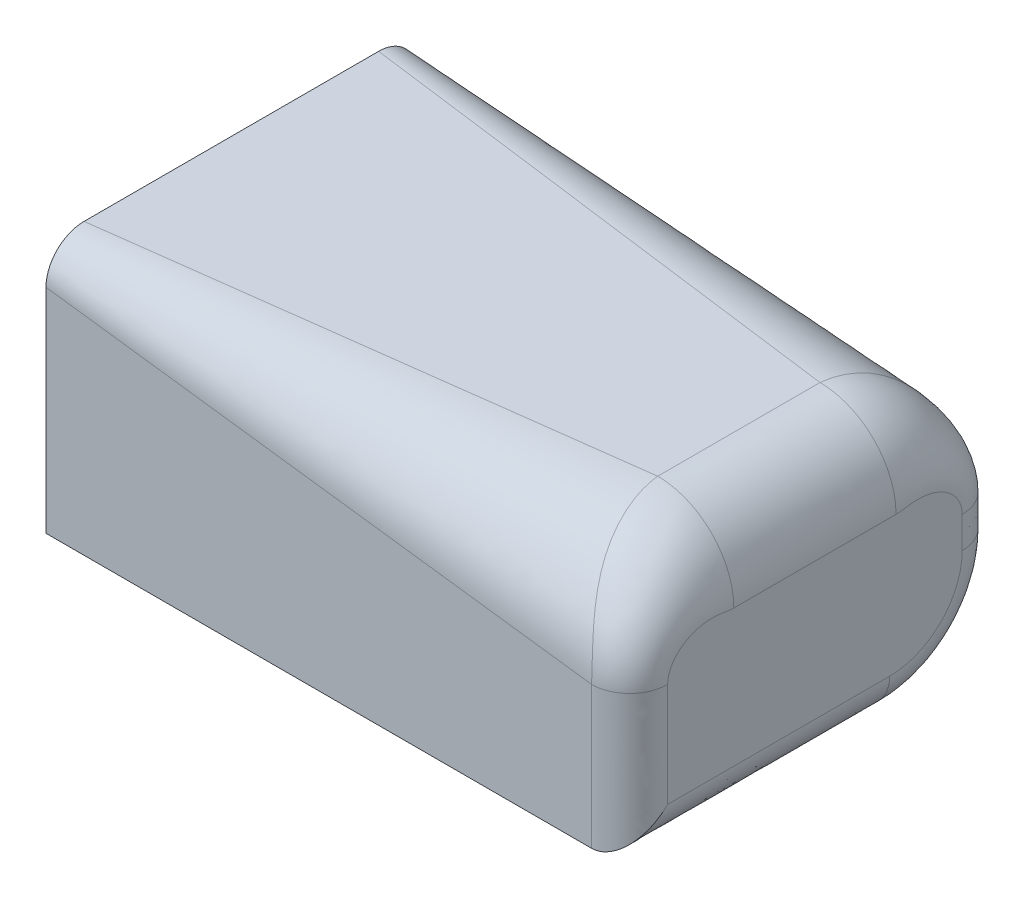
ISO-10303-21;
HEADER;
FILE_DESCRIPTION(('STEP AP214'),'2;1');
FILE_NAME('part.step','',(''),(''),'','','');
FILE_SCHEMA(('AUTOMOTIVE_DESIGN { 1 0 10303 214 1 1 1 1 }'));
ENDSEC;
DATA;
#1=APPLICATION_CONTEXT('core data for automotive mechanical design processes');
#2=APPLICATION_PROTOCOL_DEFINITION('international standard','automotive_design',2000,#1);
#3=PRODUCT_CONTEXT('',#1,'mechanical');
#4=PRODUCT('Part','Part','',(#3));
#5=PRODUCT_RELATED_PRODUCT_CATEGORY('part','',(#4));
#6=PRODUCT_DEFINITION_FORMATION('','',#4);
#7=PRODUCT_DEFINITION_CONTEXT('part definition',#1,'design');
#8=PRODUCT_DEFINITION('design','',#6,#7);
#9=PRODUCT_DEFINITION_SHAPE('','',#8);
#10=(LENGTH_UNIT() NAMED_UNIT(*) SI_UNIT(.MILLI.,.METRE.));
#11=(NAMED_UNIT(*) PLANE_ANGLE_UNIT() SI_UNIT($,.RADIAN.));
#12=(NAMED_UNIT(*) SI_UNIT($,.STERADIAN.) SOLID_ANGLE_UNIT());
#13=UNCERTAINTY_MEASURE_WITH_UNIT(LENGTH_MEASURE(1.E-05),#10,'distance_accuracy_value','');
#14=(GEOMETRIC_REPRESENTATION_CONTEXT(3) GLOBAL_UNCERTAINTY_ASSIGNED_CONTEXT((#13)) GLOBAL_UNIT_ASSIGNED_CONTEXT((#10,
#11,#12)) REPRESENTATION_CONTEXT('',''));
#15=CARTESIAN_POINT('',(0.,0.,0.));
#16=DIRECTION('',(0.,0.,1.));
#17=DIRECTION('',(1.,0.,0.));
#18=AXIS2_PLACEMENT_3D('',#15,#16,#17);
#19=CARTESIAN_POINT('',(0.,41.91,0.));
#20=DIRECTION('',(1.,0.,0.));
#21=DIRECTION('',(0.,0.,-1.));
#22=AXIS2_PLACEMENT_3D('',#19,#20,#21);
#23=PLANE('',#22);
#24=DIRECTION('',(0.,-1.,0.));
#25=VECTOR('',#24,1.);
#26=CARTESIAN_POINT('',(0.,41.91,-61.8604715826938));
#27=LINE('',#26,#25);
#28=CARTESIAN_POINT('',(0.,35.56,-61.8604715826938));
#29=VERTEX_POINT('',#28);
#30=CARTESIAN_POINT('',(0.,6.35,-61.8604715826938));
#31=VERTEX_POINT('',#30);
#32=EDGE_CURVE('E142',#29,#31,#27,.T.);
#33=ORIENTED_EDGE('',*,*,#32,.T.);
#34=CARTESIAN_POINT('',(0.,6.35,-61.8604715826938));
#35=CARTESIAN_POINT('',(0.,6.17139952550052,-61.860490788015));
#36=CARTESIAN_POINT('',(0.,5.99280180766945,-61.8529373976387));
#37=CARTESIAN_POINT('',(0.,5.63688419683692,-61.8228241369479));
#38=CARTESIAN_POINT('',(0.,5.45956424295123,-61.8002649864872));
#39=CARTESIAN_POINT('',(0.,5.10759012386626,-61.7403015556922));
#40=CARTESIAN_POINT('',(0.,4.93293404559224,-61.7029085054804));
#41=CARTESIAN_POINT('',(0.,4.58739301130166,-61.6135492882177));
#42=CARTESIAN_POINT('',(0.,4.41650800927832,-61.5615832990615));
#43=CARTESIAN_POINT('',(0.,4.07966991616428,-61.4434276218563));
#44=CARTESIAN_POINT('',(0.,3.91371833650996,-61.377233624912));
#45=CARTESIAN_POINT('',(0.,3.58792070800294,-61.2310752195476));
#46=CARTESIAN_POINT('',(0.,3.42807693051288,-61.1511057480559));
#47=CARTESIAN_POINT('',(0.,3.11575455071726,-60.9780140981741));
#48=CARTESIAN_POINT('',(0.,2.96327323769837,-60.8848968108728));
#49=CARTESIAN_POINT('',(0.,2.66669300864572,-60.686146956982));
#50=CARTESIAN_POINT('',(0.,2.52259427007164,-60.5805141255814));
#51=CARTESIAN_POINT('',(0.,2.2438098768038,-60.3574879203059));
#52=CARTESIAN_POINT('',(0.,2.10912402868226,-60.240094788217));
#53=CARTESIAN_POINT('',(0.,1.85011945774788,-59.9943805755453));
#54=CARTESIAN_POINT('',(0.,1.72580073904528,-59.86605949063));
#55=CARTESIAN_POINT('',(0.,1.48838965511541,-59.5993739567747));
#56=CARTESIAN_POINT('',(0.,1.3752996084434,-59.4610074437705));
#57=CARTESIAN_POINT('',(0.,1.16118140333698,-59.1752414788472));
#58=CARTESIAN_POINT('',(0.,1.0601529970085,-59.0278422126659));
#59=CARTESIAN_POINT('',(0.,0.870836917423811,-58.7249968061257));
#60=CARTESIAN_POINT('',(0.,0.782554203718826,-58.5695475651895));
#61=CARTESIAN_POINT('',(0.,0.619434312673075,-58.2518211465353));
#62=CARTESIAN_POINT('',(0.,0.544592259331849,-58.0895464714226));
#63=CARTESIAN_POINT('',(0.,0.408865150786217,-57.7593089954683));
#64=CARTESIAN_POINT('',(0.,0.347976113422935,-57.5913478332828));
#65=CARTESIAN_POINT('',(0.,0.240575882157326,-57.2509599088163));
#66=CARTESIAN_POINT('',(0.,0.194061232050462,-57.0785342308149));
#67=CARTESIAN_POINT('',(0.,0.103439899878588,-56.6757433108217));
#68=CARTESIAN_POINT('',(0.,0.064651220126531,-56.4441469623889));
#69=CARTESIAN_POINT('',(0.,0.0258650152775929,-56.0948927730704));
#70=CARTESIAN_POINT('',(0.,0.0161690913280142,-55.9782239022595));
#71=CARTESIAN_POINT('',(0.,0.00323738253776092,-55.7445367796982));
#72=CARTESIAN_POINT('',(0.,1.14821803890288E-06,-55.6275185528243));
#73=CARTESIAN_POINT('',(0.,0.,-55.5104715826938));
#74=B_SPLINE_CURVE_WITH_KNOTS('',3,(#34,#35,#36,#37,#38,#39,#40,#41,#42,#43,#44,#45,#46,#47,#48,
#49,#50,#51,#52,#53,#54,#55,#56,#57,#58,#59,#60,#61,#62,#63,#64,#65,#66,#67,#68,#69,#70,#71,#72,
#73),.UNSPECIFIED.,.F.,.F.,(4,2,2,2,2,2,2,2,2,2,2,2,2,2,2,2,2,2,2,4),(0.,0.535637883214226,
1.07125007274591,1.60645754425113,2.14165848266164,2.67702173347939,3.21258217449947,
3.74794390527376,4.28331696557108,4.81867902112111,5.35404128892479,5.88951387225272,
6.42497544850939,6.96064482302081,7.49611947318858,8.031441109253,8.56663393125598,
9.26946623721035,9.62052948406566,9.97156830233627),.UNSPECIFIED.);
#75=CARTESIAN_POINT('',(0.,0.,-55.5104715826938));
#76=VERTEX_POINT('',#75);
#77=EDGE_CURVE('E128',#31,#76,#74,.T.);
#78=ORIENTED_EDGE('',*,*,#77,.T.);
#79=DIRECTION('',(0.,0.,1.));
#80=VECTOR('',#79,1.);
#81=CARTESIAN_POINT('',(0.,0.,0.));
#82=LINE('',#81,#80);
#83=CARTESIAN_POINT('',(0.,0.,0.));
#84=VERTEX_POINT('',#83);
#85=EDGE_CURVE('E121',#76,#84,#82,.T.);
#86=ORIENTED_EDGE('',*,*,#85,.T.);
#87=DIRECTION('',(0.,-1.,0.));
#88=VECTOR('',#87,1.);
#89=CARTESIAN_POINT('',(0.,41.91,0.));
#90=LINE('',#89,#88);
#91=CARTESIAN_POINT('',(0.,35.56,0.));
#92=VERTEX_POINT('',#91);
#93=EDGE_CURVE('E125',#92,#84,#90,.T.);
#94=ORIENTED_EDGE('',*,*,#93,.F.);
#95=CARTESIAN_POINT('',(0.,35.56,0.));
#96=CARTESIAN_POINT('',(0.,35.7386004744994,1.92053199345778E-05));
#97=CARTESIAN_POINT('',(0.,35.9171981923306,-0.00753418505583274));
#98=CARTESIAN_POINT('',(0.,36.2731158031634,-0.0376474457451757));
#99=CARTESIAN_POINT('',(0.,36.4504357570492,-0.0602065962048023));
#100=CARTESIAN_POINT('',(0.,36.802409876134,-0.120170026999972));
#101=CARTESIAN_POINT('',(0.,36.9770659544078,-0.157563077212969));
#102=CARTESIAN_POINT('',(0.,37.3226069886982,-0.246922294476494));
#103=CARTESIAN_POINT('',(0.,37.4934919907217,-0.298888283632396));
#104=CARTESIAN_POINT('',(0.,37.8303300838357,-0.417043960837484));
#105=CARTESIAN_POINT('',(0.,37.99628166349,-0.483237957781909));
#106=CARTESIAN_POINT('',(0.,38.3220792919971,-0.629396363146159));
#107=CARTESIAN_POINT('',(0.,38.4819230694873,-0.709365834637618));
#108=CARTESIAN_POINT('',(0.,38.7942454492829,-0.882457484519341));
#109=CARTESIAN_POINT('',(0.,38.9467267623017,-0.975574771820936));
#110=CARTESIAN_POINT('',(0.,39.2433069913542,-1.17432462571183));
#111=CARTESIAN_POINT('',(0.,39.3874057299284,-1.27995745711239));
#112=CARTESIAN_POINT('',(0.,39.6661901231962,-1.50298366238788));
#113=CARTESIAN_POINT('',(0.,39.8008759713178,-1.62037679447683));
#114=CARTESIAN_POINT('',(0.,40.0598805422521,-1.86609100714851));
#115=CARTESIAN_POINT('',(0.,40.1841992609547,-1.9944120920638));
#116=CARTESIAN_POINT('',(0.,40.4216103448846,-2.26109762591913));
#117=CARTESIAN_POINT('',(0.,40.5347003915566,-2.39946413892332));
#118=CARTESIAN_POINT('',(0.,40.748818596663,-2.6852301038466));
#119=CARTESIAN_POINT('',(0.,40.8498470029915,-2.83262937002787));
#120=CARTESIAN_POINT('',(0.,41.0391630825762,-3.13547477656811));
#121=CARTESIAN_POINT('',(0.,41.1274457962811,-3.29092401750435));
#122=CARTESIAN_POINT('',(0.,41.290565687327,-3.60865043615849));
#123=CARTESIAN_POINT('',(0.,41.3654077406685,-3.77092511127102));
#124=CARTESIAN_POINT('',(0.,41.5011348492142,-4.10116258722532));
#125=CARTESIAN_POINT('',(0.,41.5620238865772,-4.26912374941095));
#126=CARTESIAN_POINT('',(0.,41.6694241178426,-4.60951167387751));
#127=CARTESIAN_POINT('',(0.,41.7159387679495,-4.78193735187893));
#128=CARTESIAN_POINT('',(0.,41.8065601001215,-5.1847282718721));
#129=CARTESIAN_POINT('',(0.,41.8453487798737,-5.41632462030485));
#130=CARTESIAN_POINT('',(0.,41.8841349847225,-5.76557880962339));
#131=CARTESIAN_POINT('',(0.,41.8938309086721,-5.88224768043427));
#132=CARTESIAN_POINT('',(0.,41.9067626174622,-6.11593480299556));
#133=CARTESIAN_POINT('',(0.,41.9099988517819,-6.23295302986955));
#134=CARTESIAN_POINT('',(0.,41.91,-6.35));
#135=B_SPLINE_CURVE_WITH_KNOTS('',3,(#95,#96,#97,#98,#99,#100,#101,#102,#103,#104,#105,#106,
#107,#108,#109,#110,#111,#112,#113,#114,#115,#116,#117,#118,#119,#120,#121,#122,#123,#124,#125,
#126,#127,#128,#129,#130,#131,#132,#133,#134),.UNSPECIFIED.,.F.,.F.,(4,2,2,2,2,2,2,2,2,2,2,2,2,
2,2,2,2,2,2,4),(0.,0.535637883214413,1.07125007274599,1.60645754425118,2.14165848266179,
2.67702173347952,3.21258217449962,3.7479439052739,4.28331696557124,4.81867902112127,
5.35404128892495,5.88951387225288,6.42497544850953,6.96064482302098,7.49611947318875,
8.03144110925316,8.56663393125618,9.26946623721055,9.62052948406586,9.97156830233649),.UNSPECIFIED.);
#136=CARTESIAN_POINT('',(0.,41.91,-6.35));
#137=VERTEX_POINT('',#136);
#138=EDGE_CURVE('E206',#92,#137,#135,.T.);
#139=ORIENTED_EDGE('',*,*,#138,.T.);
#140=DIRECTION('',(0.,0.,1.));
#141=VECTOR('',#140,1.);
#142=CARTESIAN_POINT('',(0.,41.91,0.));
#143=LINE('',#142,#141);
#144=CARTESIAN_POINT('',(0.,41.91,-55.5104715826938));
#145=VERTEX_POINT('',#144);
#146=EDGE_CURVE('E146',#145,#137,#143,.T.);
#147=ORIENTED_EDGE('',*,*,#146,.F.);
#148=CARTESIAN_POINT('',(0.,41.91,-55.5104715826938));
#149=CARTESIAN_POINT('',(0.,41.91001920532,-55.6890720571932));
#150=CARTESIAN_POINT('',(0.,41.9024658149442,-55.8676697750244));
#151=CARTESIAN_POINT('',(0.,41.8723525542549,-56.2235873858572));
#152=CARTESIAN_POINT('',(0.,41.8497934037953,-56.400907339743));
#153=CARTESIAN_POINT('',(0.,41.7898299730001,-56.7528814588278));
#154=CARTESIAN_POINT('',(0.,41.7524369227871,-56.9275375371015));
#155=CARTESIAN_POINT('',(0.,41.6630777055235,-57.273078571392));
#156=CARTESIAN_POINT('',(0.,41.6111117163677,-57.4439635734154));
#157=CARTESIAN_POINT('',(0.,41.4929560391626,-57.7808016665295));
#158=CARTESIAN_POINT('',(0.,41.4267620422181,-57.9467532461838));
#159=CARTESIAN_POINT('',(0.,41.2806036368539,-58.2725508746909));
#160=CARTESIAN_POINT('',(0.,41.2006341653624,-58.4323946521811));
#161=CARTESIAN_POINT('',(0.,41.0275425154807,-58.7447170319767));
#162=CARTESIAN_POINT('',(0.,40.9344252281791,-58.8971983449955));
#163=CARTESIAN_POINT('',(0.,40.7356753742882,-59.193778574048));
#164=CARTESIAN_POINT('',(0.,40.6300425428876,-59.3378773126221));
#165=CARTESIAN_POINT('',(0.,40.4070163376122,-59.61666170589));
#166=CARTESIAN_POINT('',(0.,40.2896232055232,-59.7513475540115));
#167=CARTESIAN_POINT('',(0.,40.0439089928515,-60.0103521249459));
#168=CARTESIAN_POINT('',(0.,39.9155879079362,-60.1346708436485));
#169=CARTESIAN_POINT('',(0.,39.6489023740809,-60.3720819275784));
#170=CARTESIAN_POINT('',(0.,39.5105358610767,-60.4851719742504));
#171=CARTESIAN_POINT('',(0.,39.2247698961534,-60.6992901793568));
#172=CARTESIAN_POINT('',(0.,39.0773706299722,-60.8003185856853));
#173=CARTESIAN_POINT('',(0.,38.774525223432,-60.98963466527));
#174=CARTESIAN_POINT('',(0.,38.6190759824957,-61.0779173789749));
#175=CARTESIAN_POINT('',(0.,38.3013495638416,-61.2410372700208));
#176=CARTESIAN_POINT('',(0.,38.139074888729,-61.3158793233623));
#177=CARTESIAN_POINT('',(0.,37.8088374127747,-61.4516064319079));
#178=CARTESIAN_POINT('',(0.,37.6408762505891,-61.512495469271));
#179=CARTESIAN_POINT('',(0.,37.3004883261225,-61.6198957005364));
#180=CARTESIAN_POINT('',(0.,37.1280626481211,-61.6664103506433));
#181=CARTESIAN_POINT('',(0.,36.7252717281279,-61.7570316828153));
#182=CARTESIAN_POINT('',(0.,36.4936753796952,-61.7958203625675));
#183=CARTESIAN_POINT('',(0.,36.1444211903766,-61.8346065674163));
#184=CARTESIAN_POINT('',(0.,36.0277523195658,-61.8443024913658));
#185=CARTESIAN_POINT('',(0.,35.7940651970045,-61.857234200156));
#186=CARTESIAN_POINT('',(0.,35.6770469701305,-61.8604704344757));
#187=CARTESIAN_POINT('',(0.,35.56,-61.8604715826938));
#188=B_SPLINE_CURVE_WITH_KNOTS('',3,(#148,#149,#150,#151,#152,#153,#154,#155,#156,#157,#158,
#159,#160,#161,#162,#163,#164,#165,#166,#167,#168,#169,#170,#171,#172,#173,#174,#175,#176,#177,
#178,#179,#180,#181,#182,#183,#184,#185,#186,#187),.UNSPECIFIED.,.F.,.F.,(4,2,2,2,2,2,2,2,2,2,2,
2,2,2,2,2,2,2,2,4),(0.,0.535637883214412,1.07125007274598,1.60645754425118,2.14165848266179,
2.67702173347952,3.21258217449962,3.74794390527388,4.28331696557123,4.81867902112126,
5.35404128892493,5.88951387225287,6.42497544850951,6.96064482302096,7.49611947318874,
8.03144110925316,8.56663393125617,9.26946623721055,9.62052948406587,9.9715683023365),.UNSPECIFIED.);
#189=EDGE_CURVE('E214',#145,#29,#188,.T.);
#190=ORIENTED_EDGE('',*,*,#189,.T.);
#191=EDGE_LOOP('',(#33,#78,#86,#94,#139,#147,#190));
#192=FACE_BOUND('',#191,.T.);
#193=ADVANCED_FACE('F34',(#192),#23,.F.);
#194=CARTESIAN_POINT('',(0.,41.91,0.));
#195=DIRECTION('',(0.,0.,-1.));
#196=DIRECTION('',(-1.,0.,0.));
#197=AXIS2_PLACEMENT_3D('',#194,#195,#196);
#198=PLANE('',#197);
#199=DIRECTION('',(1.,0.,0.));
#200=VECTOR('',#199,1.);
#201=CARTESIAN_POINT('',(0.,0.,0.));
#202=LINE('',#201,#200);
#203=CARTESIAN_POINT('',(91.0431264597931,0.,0.));
#204=VERTEX_POINT('',#203);
#205=EDGE_CURVE('E131',#84,#204,#202,.T.);
#206=ORIENTED_EDGE('',*,*,#205,.T.);
#207=CARTESIAN_POINT('',(91.0431264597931,23.6880358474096,0.));
#208=CARTESIAN_POINT('',(91.0431264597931,15.7920238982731,0.));
#209=CARTESIAN_POINT('',(91.0431264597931,7.89601194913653,0.));
#210=CARTESIAN_POINT('',(91.0431264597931,0.,0.));
#211=CARTESIAN_POINT('',(91.0431264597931,-15.792023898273,0.));
#212=CARTESIAN_POINT('',(91.0431264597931,-31.5840477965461,0.));
#213=CARTESIAN_POINT('',(91.0431264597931,-47.3760716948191,0.));
#214=(BOUNDED_CURVE() B_SPLINE_CURVE(3,(#207,#208,#209,#210,#211,#212,#213),.UNSPECIFIED.,.F.,
.F.) B_SPLINE_CURVE_WITH_KNOTS((4,3,4),(0.,0.333333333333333,1.),
.UNSPECIFIED.) CURVE() GEOMETRIC_REPRESENTATION_ITEM() RATIONAL_B_SPLINE_CURVE((1.,1.,1.,1.,1.,
1.,1.)) REPRESENTATION_ITEM(''));
#215=CARTESIAN_POINT('',(91.0431264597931,23.6880358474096,0.));
#216=VERTEX_POINT('',#215);
#217=EDGE_CURVE('E350',#204,#216,#214,.F.);
#218=ORIENTED_EDGE('',*,*,#217,.T.);
#219=CARTESIAN_POINT('',(-48.6965632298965,41.91,0.));
#220=CARTESIAN_POINT('',(-32.4643754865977,39.7933333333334,0.));
#221=CARTESIAN_POINT('',(-16.2321877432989,37.6766666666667,0.));
#222=CARTESIAN_POINT('',(0.,35.56,0.));
#223=CARTESIAN_POINT('',(32.4643754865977,31.3266666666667,0.));
#224=CARTESIAN_POINT('',(64.9287509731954,27.0933333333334,0.));
#225=CARTESIAN_POINT('',(97.3931264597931,22.86,0.));
#226=CARTESIAN_POINT('',(162.321877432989,14.3933333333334,0.));
#227=CARTESIAN_POINT('',(227.250628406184,5.9266666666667,0.));
#228=CARTESIAN_POINT('',(292.179379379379,-2.53999999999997,0.));
#229=(BOUNDED_CURVE() B_SPLINE_CURVE(3,(#219,#220,#221,#222,#223,#224,#225,#226,#227,#228),
.UNSPECIFIED.,.F.,.F.) B_SPLINE_CURVE_WITH_KNOTS((4,3,3,4),(0.,0.142857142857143,
0.428571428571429,1.),
.UNSPECIFIED.) CURVE() GEOMETRIC_REPRESENTATION_ITEM() RATIONAL_B_SPLINE_CURVE((1.,1.,1.,1.,1.,
1.,1.,1.,1.,1.)) REPRESENTATION_ITEM(''));
#230=EDGE_CURVE('E140',#216,#92,#229,.F.);
#231=ORIENTED_EDGE('',*,*,#230,.T.);
#232=ORIENTED_EDGE('',*,*,#93,.T.);
#233=EDGE_LOOP('',(#206,#218,#231,#232));
#234=FACE_BOUND('',#233,.T.);
#235=ADVANCED_FACE('F136',(#234),#198,.F.);
#236=CARTESIAN_POINT('',(97.3931264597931,41.91,0.));
#237=DIRECTION('',(-1.,0.,0.));
#238=DIRECTION('',(0.,0.,1.));
#239=AXIS2_PLACEMENT_3D('',#236,#237,#238);
#240=PLANE('',#239);
#241=CARTESIAN_POINT('',(97.393126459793,23.6880358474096,-6.35));
#242=CARTESIAN_POINT('',(97.393126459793,25.0311588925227,-6.35000000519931));
#243=CARTESIAN_POINT('',(97.3931264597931,26.3203845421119,-6.98325020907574));
#244=CARTESIAN_POINT('',(97.3931264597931,28.2461617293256,-8.85873323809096));
#245=CARTESIAN_POINT('',(97.3931264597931,28.9088958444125,-10.1025509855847));
#246=CARTESIAN_POINT('',(97.3931264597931,29.4087415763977,-11.943340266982));
#247=CARTESIAN_POINT('',(97.3931264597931,29.4999722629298,-12.5547399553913));
#248=CARTESIAN_POINT('',(97.3931264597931,29.5769165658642,-13.7292094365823));
#249=CARTESIAN_POINT('',(97.3931264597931,29.5613032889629,-14.2919998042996));
#250=CARTESIAN_POINT('',(97.3931264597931,29.4687752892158,-15.3227854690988));
#251=CARTESIAN_POINT('',(97.3931264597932,29.3946591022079,-15.7939141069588));
#252=CARTESIAN_POINT('',(97.3931264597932,29.2657520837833,-16.6522991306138));
#253=CARTESIAN_POINT('',(97.3931264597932,29.2100000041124,-17.0422820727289));
#254=CARTESIAN_POINT('',(97.3931264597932,29.21,-17.3939283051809));
#255=(BOUNDED_CURVE() B_SPLINE_CURVE(3,(#241,#242,#243,#244,#245,#246,#247,#248,#249,#250,#251,
#252,#253,#254),.UNSPECIFIED.,.F.,.F.) B_SPLINE_CURVE_WITH_KNOTS((4,2,2,2,2,2,4),
(0.00484269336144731,0.0107652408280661,0.0166877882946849,0.0196490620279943,
0.0226103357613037,0.0255716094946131,0.0285328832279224),
.UNSPECIFIED.) CURVE() GEOMETRIC_REPRESENTATION_ITEM() RATIONAL_B_SPLINE_CURVE((1.,1.,1.,1.,1.,
1.,1.,1.,1.,1.,1.,1.,1.,1.)) REPRESENTATION_ITEM(''));
#256=CARTESIAN_POINT('',(97.3931264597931,29.21,-17.3939283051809));
#257=VERTEX_POINT('',#256);
#258=CARTESIAN_POINT('',(97.3931264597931,23.6880358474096,-6.35));
#259=VERTEX_POINT('',#258);
#260=EDGE_CURVE('E319',#257,#259,#255,.F.);
#261=ORIENTED_EDGE('',*,*,#260,.T.);
#262=CARTESIAN_POINT('',(97.3931264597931,23.6880358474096,-6.35));
#263=CARTESIAN_POINT('',(97.3931264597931,15.792023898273,-6.35));
#264=CARTESIAN_POINT('',(97.3931264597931,7.89601194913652,-6.35));
#265=CARTESIAN_POINT('',(97.3931264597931,0.,-6.35));
#266=CARTESIAN_POINT('',(97.3931264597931,-15.792023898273,-6.35));
#267=CARTESIAN_POINT('',(97.3931264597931,-31.5840477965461,-6.35));
#268=CARTESIAN_POINT('',(97.3931264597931,-47.3760716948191,-6.35));
#269=(BOUNDED_CURVE() B_SPLINE_CURVE(3,(#262,#263,#264,#265,#266,#267,#268),.UNSPECIFIED.,.F.,
.F.) B_SPLINE_CURVE_WITH_KNOTS((4,3,4),(0.,0.333333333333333,1.),
.UNSPECIFIED.) CURVE() GEOMETRIC_REPRESENTATION_ITEM() RATIONAL_B_SPLINE_CURVE((1.,1.,1.,1.,1.,
1.,1.)) REPRESENTATION_ITEM(''));
#270=CARTESIAN_POINT('',(97.3931264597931,6.35,-6.35));
#271=VERTEX_POINT('',#270);
#272=EDGE_CURVE('E331',#259,#271,#269,.T.);
#273=ORIENTED_EDGE('',*,*,#272,.T.);
#274=CARTESIAN_POINT('',(97.3931264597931,6.35,86.804007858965));
#275=CARTESIAN_POINT('',(97.3931264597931,6.35,57.8693385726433));
#276=CARTESIAN_POINT('',(97.3931264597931,6.35,28.9346692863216));
#277=CARTESIAN_POINT('',(97.3931264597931,6.35,0.));
#278=CARTESIAN_POINT('',(97.3931264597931,6.35,-14.4673346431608));
#279=CARTESIAN_POINT('',(97.3931264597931,6.35,-28.9346692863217));
#280=CARTESIAN_POINT('',(97.3931264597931,6.35,-43.4020039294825));
#281=(BOUNDED_CURVE() B_SPLINE_CURVE(3,(#274,#275,#276,#277,#278,#279,#280),.UNSPECIFIED.,.F.,
.F.) B_SPLINE_CURVE_WITH_KNOTS((4,3,4),(0.,0.666666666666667,1.),
.UNSPECIFIED.) CURVE() GEOMETRIC_REPRESENTATION_ITEM() RATIONAL_B_SPLINE_CURVE((1.,1.,1.,1.,1.,
1.,1.)) REPRESENTATION_ITEM(''));
#282=CARTESIAN_POINT('',(97.3931264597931,6.35,-43.4020039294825));
#283=VERTEX_POINT('',#282);
#284=EDGE_CURVE('E266',#271,#283,#281,.T.);
#285=ORIENTED_EDGE('',*,*,#284,.T.);
#286=CARTESIAN_POINT('',(97.3931264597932,18.4584676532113,-55.5104715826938));
#287=CARTESIAN_POINT('',(97.3931264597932,16.8818557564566,-55.5104715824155));
#288=CARTESIAN_POINT('',(97.3931264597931,15.2974323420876,-55.1915940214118));
#289=CARTESIAN_POINT('',(97.3931264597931,13.1114094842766,-54.2822917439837));
#290=CARTESIAN_POINT('',(97.393126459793,12.4026347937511,-53.902794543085));
#291=CARTESIAN_POINT('',(97.393126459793,11.0777630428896,-53.0146479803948));
#292=CARTESIAN_POINT('',(97.3931264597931,10.4656694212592,-52.5107585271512));
#293=CARTESIAN_POINT('',(97.3931264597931,9.34414255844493,-51.3884567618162));
#294=CARTESIAN_POINT('',(97.3931264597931,8.83074133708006,-50.7627681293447));
#295=CARTESIAN_POINT('',(97.3931264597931,7.94813541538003,-49.4409728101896));
#296=CARTESIAN_POINT('',(97.3931264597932,7.57523969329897,-48.7435423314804));
#297=CARTESIAN_POINT('',(97.3931264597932,6.6642186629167,-46.5487148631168));
#298=CARTESIAN_POINT('',(97.3931264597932,6.35000000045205,-44.9564736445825));
#299=CARTESIAN_POINT('',(97.3931264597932,6.35,-43.4020039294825));
#300=(BOUNDED_CURVE() B_SPLINE_CURVE(3,(#286,#287,#288,#289,#290,#291,#292,#293,#294,#295,#296,
#297,#298,#299),.UNSPECIFIED.,.F.,.F.) B_SPLINE_CURVE_WITH_KNOTS((4,2,2,2,2,2,4),
(0.00087722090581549,0.00787869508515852,0.01137943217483,0.0148801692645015,0.0183809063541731,
0.0218816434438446,0.0288831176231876),
.UNSPECIFIED.) CURVE() GEOMETRIC_REPRESENTATION_ITEM() RATIONAL_B_SPLINE_CURVE((1.,1.,1.,1.,1.,
1.,1.,1.,1.,1.,1.,1.,1.,1.)) REPRESENTATION_ITEM(''));
#301=CARTESIAN_POINT('',(97.3931264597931,18.4584676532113,-55.5104715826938));
#302=VERTEX_POINT('',#301);
#303=EDGE_CURVE('E281',#283,#302,#300,.F.);
#304=ORIENTED_EDGE('',*,*,#303,.T.);
#305=CARTESIAN_POINT('',(97.3931264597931,23.6880358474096,-55.5104715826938));
#306=CARTESIAN_POINT('',(97.3931264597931,21.9448464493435,-55.5104715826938));
#307=CARTESIAN_POINT('',(97.3931264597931,20.2016570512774,-55.5104715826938));
#308=CARTESIAN_POINT('',(97.3931264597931,18.4584676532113,-55.5104715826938));
#309=(BOUNDED_CURVE() B_SPLINE_CURVE(3,(#305,#306,#307,#308),.UNSPECIFIED.,.F.,
.F.) B_SPLINE_CURVE_WITH_KNOTS((4,4),(0.,1.),
.UNSPECIFIED.) CURVE() GEOMETRIC_REPRESENTATION_ITEM() RATIONAL_B_SPLINE_CURVE((1.,1.,1.,1.)) REPRESENTATION_ITEM(''));
#310=CARTESIAN_POINT('',(97.3931264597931,23.6880358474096,-55.5104715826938));
#311=VERTEX_POINT('',#310);
#312=EDGE_CURVE('E494',#302,#311,#309,.F.);
#313=ORIENTED_EDGE('',*,*,#312,.T.);
#314=CARTESIAN_POINT('',(97.3931264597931,29.21,-44.4665432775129));
#315=CARTESIAN_POINT('',(97.3931264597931,29.2100000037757,-44.8210024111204));
#316=CARTESIAN_POINT('',(97.3931264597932,29.2663256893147,-45.2041266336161));
#317=CARTESIAN_POINT('',(97.3931264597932,29.3967037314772,-46.060344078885));
#318=CARTESIAN_POINT('',(97.3931264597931,29.4705389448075,-46.5346561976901));
#319=CARTESIAN_POINT('',(97.3931264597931,29.5580284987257,-47.5743202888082));
#320=CARTESIAN_POINT('',(97.3931264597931,29.5761682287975,-48.131954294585));
#321=CARTESIAN_POINT('',(97.3931264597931,29.5030079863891,-49.3023673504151));
#322=CARTESIAN_POINT('',(97.3931264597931,29.4115811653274,-49.9151136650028));
#323=CARTESIAN_POINT('',(97.3931264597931,28.8959439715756,-51.7677391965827));
#324=CARTESIAN_POINT('',(97.3931264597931,28.252396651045,-53.0002592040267));
#325=CARTESIAN_POINT('',(97.3931264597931,26.3033927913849,-54.882386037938));
#326=CARTESIAN_POINT('',(97.3931264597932,25.0183756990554,-55.5104715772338));
#327=CARTESIAN_POINT('',(97.3931264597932,23.6880358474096,-55.5104715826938));
#328=(BOUNDED_CURVE() B_SPLINE_CURVE(3,(#314,#315,#316,#317,#318,#319,#320,#321,#322,#323,#324,
#325,#326,#327),.UNSPECIFIED.,.F.,.F.) B_SPLINE_CURVE_WITH_KNOTS((4,2,2,2,2,2,4),
(0.00122860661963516,0.00419370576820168,0.0071588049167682,0.0101239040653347,
0.0130890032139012,0.0190192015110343,0.0249493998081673),
.UNSPECIFIED.) CURVE() GEOMETRIC_REPRESENTATION_ITEM() RATIONAL_B_SPLINE_CURVE((1.,1.,1.,1.,1.,
1.,1.,1.,1.,1.,1.,1.,1.,1.)) REPRESENTATION_ITEM(''));
#329=CARTESIAN_POINT('',(97.3931264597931,29.21,-44.4665432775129));
#330=VERTEX_POINT('',#329);
#331=EDGE_CURVE('E320',#311,#330,#328,.F.);
#332=ORIENTED_EDGE('',*,*,#331,.T.);
#333=CARTESIAN_POINT('',(97.3931264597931,29.21,-17.3939283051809));
#334=CARTESIAN_POINT('',(97.3931264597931,29.21,-26.4181332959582));
#335=CARTESIAN_POINT('',(97.3931264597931,29.21,-35.4423382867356));
#336=CARTESIAN_POINT('',(97.3931264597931,29.21,-44.4665432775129));
#337=(BOUNDED_CURVE() B_SPLINE_CURVE(3,(#333,#334,#335,#336),.UNSPECIFIED.,.F.,
.F.) B_SPLINE_CURVE_WITH_KNOTS((4,4),(0.,1.),
.UNSPECIFIED.) CURVE() GEOMETRIC_REPRESENTATION_ITEM() RATIONAL_B_SPLINE_CURVE((1.,1.,1.,1.)) REPRESENTATION_ITEM(''));
#338=EDGE_CURVE('E312',#330,#257,#337,.F.);
#339=ORIENTED_EDGE('',*,*,#338,.T.);
#340=EDGE_LOOP('',(#261,#273,#285,#304,#313,#332,#339));
#341=FACE_BOUND('',#340,.T.);
#342=ADVANCED_FACE('F288',(#341),#240,.F.);
#343=CARTESIAN_POINT('',(0.,41.91,-61.8604715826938));
#344=DIRECTION('',(0.,0.,1.));
#345=DIRECTION('',(1.,0.,0.));
#346=AXIS2_PLACEMENT_3D('',#343,#344,#345);
#347=PLANE('',#346);
#348=CARTESIAN_POINT('',(292.179379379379,-2.53999999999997,-61.8604715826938));
#349=CARTESIAN_POINT('',(227.250628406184,5.9266666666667,-61.8604715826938));
#350=CARTESIAN_POINT('',(162.321877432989,14.3933333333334,-61.8604715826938));
#351=CARTESIAN_POINT('',(97.3931264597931,22.86,-61.8604715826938));
#352=CARTESIAN_POINT('',(64.9287509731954,27.0933333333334,-61.8604715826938));
#353=CARTESIAN_POINT('',(32.4643754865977,31.3266666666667,-61.8604715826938));
#354=CARTESIAN_POINT('',(0.,35.56,-61.8604715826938));
#355=CARTESIAN_POINT('',(-16.2321877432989,37.6766666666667,-61.8604715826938));
#356=CARTESIAN_POINT('',(-32.4643754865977,39.7933333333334,-61.8604715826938));
#357=CARTESIAN_POINT('',(-48.6965632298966,41.91,-61.8604715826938));
#358=(BOUNDED_CURVE() B_SPLINE_CURVE(3,(#348,#349,#350,#351,#352,#353,#354,#355,#356,#357),
.UNSPECIFIED.,.F.,.F.) B_SPLINE_CURVE_WITH_KNOTS((4,3,3,4),(0.,0.571428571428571,
0.857142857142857,1.),
.UNSPECIFIED.) CURVE() GEOMETRIC_REPRESENTATION_ITEM() RATIONAL_B_SPLINE_CURVE((1.,1.,1.,1.,1.,
1.,1.,1.,1.,1.)) REPRESENTATION_ITEM(''));
#359=CARTESIAN_POINT('',(91.0431264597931,23.6880358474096,-61.8604715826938));
#360=VERTEX_POINT('',#359);
#361=EDGE_CURVE('E222',#29,#360,#358,.F.);
#362=ORIENTED_EDGE('',*,*,#361,.T.);
#363=CARTESIAN_POINT('',(91.0431264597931,23.6880358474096,-61.8604715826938));
#364=CARTESIAN_POINT('',(91.0431264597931,21.9448464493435,-61.8604715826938));
#365=CARTESIAN_POINT('',(91.0431264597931,20.2016570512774,-61.8604715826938));
#366=CARTESIAN_POINT('',(91.0431264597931,18.4584676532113,-61.8604715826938));
#367=(BOUNDED_CURVE() B_SPLINE_CURVE(3,(#363,#364,#365,#366),.UNSPECIFIED.,.F.,
.F.) B_SPLINE_CURVE_WITH_KNOTS((4,4),(0.,1.),
.UNSPECIFIED.) CURVE() GEOMETRIC_REPRESENTATION_ITEM() RATIONAL_B_SPLINE_CURVE((1.,1.,1.,1.)) REPRESENTATION_ITEM(''));
#368=CARTESIAN_POINT('',(91.0431264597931,18.4584676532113,-61.8604715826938));
#369=VERTEX_POINT('',#368);
#370=EDGE_CURVE('E63',#360,#369,#367,.T.);
#371=ORIENTED_EDGE('',*,*,#370,.T.);
#372=CARTESIAN_POINT('',(292.179379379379,19.05,-61.8604715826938));
#373=CARTESIAN_POINT('',(227.250628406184,19.05,-61.8604715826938));
#374=CARTESIAN_POINT('',(162.321877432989,19.05,-61.8604715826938));
#375=CARTESIAN_POINT('',(97.3931264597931,19.05,-61.8604715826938));
#376=CARTESIAN_POINT('',(81.1609387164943,19.05,-61.8604715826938));
#377=CARTESIAN_POINT('',(64.9287509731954,6.35,-61.8604715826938));
#378=CARTESIAN_POINT('',(48.6965632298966,6.35,-61.8604715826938));
#379=CARTESIAN_POINT('',(-32.4643754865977,6.35,-61.8604715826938));
#380=CARTESIAN_POINT('',(-113.625314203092,6.35,-61.8604715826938));
#381=CARTESIAN_POINT('',(-194.786252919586,6.35,-61.8604715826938));
#382=(BOUNDED_CURVE() B_SPLINE_CURVE(3,(#372,#373,#374,#375,#376,#377,#378,#379,#380,#381),
.UNSPECIFIED.,.F.,.F.) B_SPLINE_CURVE_WITH_KNOTS((4,3,3,4),(0.,0.4,0.5,1.),
.UNSPECIFIED.) CURVE() GEOMETRIC_REPRESENTATION_ITEM() RATIONAL_B_SPLINE_CURVE((1.,1.,1.,1.,1.,
1.,1.,1.,1.,1.)) REPRESENTATION_ITEM(''));
#383=EDGE_CURVE('E237',#369,#31,#382,.T.);
#384=ORIENTED_EDGE('',*,*,#383,.T.);
#385=ORIENTED_EDGE('',*,*,#32,.F.);
#386=EDGE_LOOP('',(#362,#371,#384,#385));
#387=FACE_BOUND('',#386,.T.);
#388=ADVANCED_FACE('F297',(#387),#347,.F.);
#389=CARTESIAN_POINT('',(0.,41.91,-61.8604715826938));
#390=DIRECTION('',(0.,-1.,0.));
#391=DIRECTION('',(0.,0.,-1.));
#392=AXIS2_PLACEMENT_3D('',#389,#390,#391);
#393=PLANE('',#392);
#394=CARTESIAN_POINT('',(-48.6965632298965,41.91,0.));
#395=CARTESIAN_POINT('',(-32.4643754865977,41.91,-2.11666666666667));
#396=CARTESIAN_POINT('',(-16.2321877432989,41.91,-4.23333333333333));
#397=CARTESIAN_POINT('',(0.,41.91,-6.35));
#398=CARTESIAN_POINT('',(32.4643754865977,41.91,-10.5833333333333));
#399=CARTESIAN_POINT('',(64.9287509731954,41.91,-14.8166666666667));
#400=CARTESIAN_POINT('',(97.3931264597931,41.91,-19.05));
#401=CARTESIAN_POINT('',(162.321877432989,41.91,-27.5166666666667));
#402=CARTESIAN_POINT('',(227.250628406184,41.91,-35.9833333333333));
#403=CARTESIAN_POINT('',(292.179379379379,41.91,-44.45));
#404=(BOUNDED_CURVE() B_SPLINE_CURVE(3,(#394,#395,#396,#397,#398,#399,#400,#401,#402,#403),
.UNSPECIFIED.,.F.,.F.) B_SPLINE_CURVE_WITH_KNOTS((4,3,3,4),(0.,0.142857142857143,
0.428571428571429,1.),
.UNSPECIFIED.) CURVE() GEOMETRIC_REPRESENTATION_ITEM() RATIONAL_B_SPLINE_CURVE((1.,1.,1.,1.,1.,
1.,1.,1.,1.,1.)) REPRESENTATION_ITEM(''));
#405=CARTESIAN_POINT('',(84.6931264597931,41.91,-17.3939283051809));
#406=VERTEX_POINT('',#405);
#407=EDGE_CURVE('E141',#137,#406,#404,.T.);
#408=ORIENTED_EDGE('',*,*,#407,.T.);
#409=CARTESIAN_POINT('',(84.6931264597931,41.91,-17.3939283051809));
#410=CARTESIAN_POINT('',(84.6931264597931,41.91,-26.4181332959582));
#411=CARTESIAN_POINT('',(84.6931264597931,41.91,-35.4423382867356));
#412=CARTESIAN_POINT('',(84.6931264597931,41.91,-44.4665432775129));
#413=(BOUNDED_CURVE() B_SPLINE_CURVE(3,(#409,#410,#411,#412),.UNSPECIFIED.,.F.,
.F.) B_SPLINE_CURVE_WITH_KNOTS((4,4),(0.,1.),
.UNSPECIFIED.) CURVE() GEOMETRIC_REPRESENTATION_ITEM() RATIONAL_B_SPLINE_CURVE((1.,1.,1.,1.)) REPRESENTATION_ITEM(''));
#414=CARTESIAN_POINT('',(84.6931264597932,41.91,-44.4665432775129));
#415=VERTEX_POINT('',#414);
#416=EDGE_CURVE('E359',#406,#415,#413,.T.);
#417=ORIENTED_EDGE('',*,*,#416,.T.);
#418=CARTESIAN_POINT('',(292.179379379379,41.91,-17.4104715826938));
#419=CARTESIAN_POINT('',(227.250628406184,41.91,-25.8771382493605));
#420=CARTESIAN_POINT('',(162.321877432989,41.91,-34.3438049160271));
#421=CARTESIAN_POINT('',(97.3931264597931,41.91,-42.8104715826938));
#422=CARTESIAN_POINT('',(64.9287509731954,41.91,-47.0438049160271));
#423=CARTESIAN_POINT('',(32.4643754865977,41.91,-51.2771382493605));
#424=CARTESIAN_POINT('',(0.,41.91,-55.5104715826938));
#425=CARTESIAN_POINT('',(-16.2321877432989,41.91,-57.6271382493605));
#426=CARTESIAN_POINT('',(-32.4643754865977,41.91,-59.7438049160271));
#427=CARTESIAN_POINT('',(-48.6965632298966,41.91,-61.8604715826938));
#428=(BOUNDED_CURVE() B_SPLINE_CURVE(3,(#418,#419,#420,#421,#422,#423,#424,#425,#426,#427),
.UNSPECIFIED.,.F.,.F.) B_SPLINE_CURVE_WITH_KNOTS((4,3,3,4),(0.,0.571428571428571,
0.857142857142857,1.),
.UNSPECIFIED.) CURVE() GEOMETRIC_REPRESENTATION_ITEM() RATIONAL_B_SPLINE_CURVE((1.,1.,1.,1.,1.,
1.,1.,1.,1.,1.)) REPRESENTATION_ITEM(''));
#429=EDGE_CURVE('E180',#415,#145,#428,.T.);
#430=ORIENTED_EDGE('',*,*,#429,.T.);
#431=ORIENTED_EDGE('',*,*,#146,.T.);
#432=EDGE_LOOP('',(#408,#417,#430,#431));
#433=FACE_BOUND('',#432,.T.);
#434=ADVANCED_FACE('F362',(#433),#393,.F.);
#435=CARTESIAN_POINT('',(0.,0.,-61.8604715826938));
#436=DIRECTION('',(0.,-1.,0.));
#437=DIRECTION('',(0.,0.,-1.));
#438=AXIS2_PLACEMENT_3D('',#435,#436,#437);
#439=PLANE('',#438);
#440=CARTESIAN_POINT('',(292.179379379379,0.,-42.8104715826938));
#441=CARTESIAN_POINT('',(227.250628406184,0.,-42.8104715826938));
#442=CARTESIAN_POINT('',(162.321877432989,0.,-42.8104715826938));
#443=CARTESIAN_POINT('',(97.3931264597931,0.,-42.8104715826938));
#444=CARTESIAN_POINT('',(81.1609387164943,0.,-42.8104715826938));
#445=CARTESIAN_POINT('',(64.9287509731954,0.,-55.5104715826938));
#446=CARTESIAN_POINT('',(48.6965632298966,0.,-55.5104715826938));
#447=CARTESIAN_POINT('',(-32.4643754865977,0.,-55.5104715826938));
#448=CARTESIAN_POINT('',(-113.625314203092,0.,-55.5104715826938));
#449=CARTESIAN_POINT('',(-194.786252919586,0.,-55.5104715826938));
#450=(BOUNDED_CURVE() B_SPLINE_CURVE(3,(#440,#441,#442,#443,#444,#445,#446,#447,#448,#449),
.UNSPECIFIED.,.F.,.F.) B_SPLINE_CURVE_WITH_KNOTS((4,3,3,4),(0.,0.4,0.5,1.),
.UNSPECIFIED.) CURVE() GEOMETRIC_REPRESENTATION_ITEM() RATIONAL_B_SPLINE_CURVE((1.,1.,1.,1.,1.,
1.,1.,1.,1.,1.)) REPRESENTATION_ITEM(''));
#451=CARTESIAN_POINT('',(91.0431264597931,0.,-43.4020039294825));
#452=VERTEX_POINT('',#451);
#453=EDGE_CURVE('E261',#76,#452,#450,.F.);
#454=ORIENTED_EDGE('',*,*,#453,.T.);
#455=CARTESIAN_POINT('',(91.0431264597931,0.,86.804007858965));
#456=CARTESIAN_POINT('',(91.0431264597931,0.,57.8693385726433));
#457=CARTESIAN_POINT('',(91.0431264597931,0.,28.9346692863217));
#458=CARTESIAN_POINT('',(91.0431264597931,0.,0.));
#459=CARTESIAN_POINT('',(91.0431264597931,0.,-14.4673346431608));
#460=CARTESIAN_POINT('',(91.0431264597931,0.,-28.9346692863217));
#461=CARTESIAN_POINT('',(91.0431264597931,0.,-43.4020039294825));
#462=(BOUNDED_CURVE() B_SPLINE_CURVE(3,(#455,#456,#457,#458,#459,#460,#461),.UNSPECIFIED.,.F.,
.F.) B_SPLINE_CURVE_WITH_KNOTS((4,3,4),(0.,0.666666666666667,1.),
.UNSPECIFIED.) CURVE() GEOMETRIC_REPRESENTATION_ITEM() RATIONAL_B_SPLINE_CURVE((1.,1.,1.,1.,1.,
1.,1.)) REPRESENTATION_ITEM(''));
#463=EDGE_CURVE('E12',#452,#204,#462,.F.);
#464=ORIENTED_EDGE('',*,*,#463,.T.);
#465=ORIENTED_EDGE('',*,*,#205,.F.);
#466=ORIENTED_EDGE('',*,*,#85,.F.);
#467=EDGE_LOOP('',(#454,#464,#465,#466));
#468=FACE_BOUND('',#467,.T.);
#469=ADVANCED_FACE('F144',(#468),#439,.T.);
#470=CARTESIAN_POINT('',(-19.4786252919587,41.91,-3.80999999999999));
#471=CARTESIAN_POINT('',(-12.9857501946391,41.91,-4.65666666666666));
#472=CARTESIAN_POINT('',(-6.49287509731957,41.91,-5.50333333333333));
#473=CARTESIAN_POINT('',(0.,41.91,-6.35));
#474=CARTESIAN_POINT('',(32.4643754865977,41.91,-10.5833333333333));
#475=CARTESIAN_POINT('',(64.9287509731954,41.91,-14.8166666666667));
#476=CARTESIAN_POINT('',(97.3931264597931,41.91,-19.05));
#477=CARTESIAN_POINT('',(103.886001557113,41.91,-19.8966666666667));
#478=CARTESIAN_POINT('',(110.378876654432,41.91,-20.7433333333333));
#479=CARTESIAN_POINT('',(116.871751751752,41.91,-21.59));
#480=CARTESIAN_POINT('',(-19.4786252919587,41.91,0.));
#481=CARTESIAN_POINT('',(-12.9857501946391,41.91,0.));
#482=CARTESIAN_POINT('',(-6.49287509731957,41.91,0.));
#483=CARTESIAN_POINT('',(0.,41.91,0.));
#484=CARTESIAN_POINT('',(32.4643754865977,41.91,0.));
#485=CARTESIAN_POINT('',(64.9287509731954,41.91,0.));
#486=CARTESIAN_POINT('',(97.3931264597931,41.91,0.));
#487=CARTESIAN_POINT('',(103.886001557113,41.91,0.));
#488=CARTESIAN_POINT('',(110.378876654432,41.91,0.));
#489=CARTESIAN_POINT('',(116.871751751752,41.91,0.));
#490=CARTESIAN_POINT('',(-19.4786252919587,38.1,0.));
#491=CARTESIAN_POINT('',(-12.9857501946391,37.2533333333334,0.));
#492=CARTESIAN_POINT('',(-6.49287509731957,36.4066666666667,0.));
#493=CARTESIAN_POINT('',(0.,35.56,0.));
#494=CARTESIAN_POINT('',(32.4643754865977,31.3266666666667,0.));
#495=CARTESIAN_POINT('',(64.9287509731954,27.0933333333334,0.));
#496=CARTESIAN_POINT('',(97.3931264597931,22.86,0.));
#497=CARTESIAN_POINT('',(103.886001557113,22.0133333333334,0.));
#498=CARTESIAN_POINT('',(110.378876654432,21.1666666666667,0.));
#499=CARTESIAN_POINT('',(116.871751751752,20.32,0.));
#500=(BOUNDED_SURFACE() B_SPLINE_SURFACE(2,3,((#470,#471,#472,#473,#474,#475,#476,#477,#478,
#479),(#480,#481,#482,#483,#484,#485,#486,#487,#488,#489),(#490,#491,#492,#493,#494,#495,#496,
#497,#498,#499)),.UNSPECIFIED.,.F.,.F.,.F.) B_SPLINE_SURFACE_WITH_KNOTS((3,3),(4,3,3,4),(0.,1.),
(0.0857142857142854,0.142857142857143,0.428571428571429,0.485714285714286),
.UNSPECIFIED.) GEOMETRIC_REPRESENTATION_ITEM() RATIONAL_B_SPLINE_SURFACE(((1.,1.,1.,1.,1.,1.,1.,
1.,1.,1.),(0.707106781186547,0.707106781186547,0.707106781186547,0.707106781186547,
0.707106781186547,0.707106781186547,0.707106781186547,0.707106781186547,0.707106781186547,
0.707106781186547),(1.,1.,1.,1.,1.,1.,1.,1.,1.,1.))) REPRESENTATION_ITEM('') SURFACE());
#501=CARTESIAN_POINT('',(91.0431264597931,23.6880358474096,0.));
#502=CARTESIAN_POINT('',(91.0499875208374,23.8382743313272,1.69324755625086E-06));
#503=CARTESIAN_POINT('',(91.0544621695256,23.988610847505,-0.00188014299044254));
#504=CARTESIAN_POINT('',(91.0589851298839,24.2927271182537,-0.00945201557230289));
#505=CARTESIAN_POINT('',(91.058928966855,24.4465063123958,-0.0152288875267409));
#506=CARTESIAN_POINT('',(91.0543935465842,24.7573710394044,-0.0308085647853));
#507=CARTESIAN_POINT('',(91.0498116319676,24.9144504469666,-0.0407017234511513));
#508=CARTESIAN_POINT('',(91.036221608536,25.2317699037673,-0.0647297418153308));
#509=CARTESIAN_POINT('',(91.0271130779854,25.3919985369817,-0.0789578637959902));
#510=CARTESIAN_POINT('',(91.004467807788,25.7154505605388,-0.111871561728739));
#511=CARTESIAN_POINT('',(90.990833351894,25.8786573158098,-0.130652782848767));
#512=CARTESIAN_POINT('',(90.9591333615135,26.2078817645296,-0.17288617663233));
#513=CARTESIAN_POINT('',(90.9409731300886,26.3738777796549,-0.196435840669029));
#514=CARTESIAN_POINT('',(90.9002186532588,26.708477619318,-0.248416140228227));
#515=CARTESIAN_POINT('',(90.877532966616,26.8770549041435,-0.276945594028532));
#516=CARTESIAN_POINT('',(90.8277240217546,27.2165945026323,-0.33909029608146));
#517=CARTESIAN_POINT('',(90.8005127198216,27.3875256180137,-0.372805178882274));
#518=CARTESIAN_POINT('',(90.7416503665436,27.7315304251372,-0.445518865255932));
#519=CARTESIAN_POINT('',(90.7099147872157,27.9045684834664,-0.484617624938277));
#520=CARTESIAN_POINT('',(90.6419958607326,28.2525234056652,-0.568287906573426));
#521=CARTESIAN_POINT('',(90.6057314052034,28.4274004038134,-0.612959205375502));
#522=CARTESIAN_POINT('',(90.5287689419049,28.7787537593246,-0.707955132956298));
#523=CARTESIAN_POINT('',(90.48799370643,28.9551863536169,-0.758378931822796));
#524=CARTESIAN_POINT('',(90.4019382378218,29.3093340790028,-0.865038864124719));
#525=CARTESIAN_POINT('',(90.3565828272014,29.4870014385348,-0.921372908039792));
#526=CARTESIAN_POINT('',(90.2712500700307,29.8072301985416,-1.02800503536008));
#527=CARTESIAN_POINT('',(90.2318282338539,29.9502104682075,-1.07749412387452));
#528=CARTESIAN_POINT('',(90.14913201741,30.2421776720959,-1.18241165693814));
#529=CARTESIAN_POINT('',(90.1057644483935,30.3910745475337,-1.2380163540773));
#530=CARTESIAN_POINT('',(89.9664397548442,30.8576648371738,-1.41888223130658));
#531=CARTESIAN_POINT('',(89.8675005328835,31.1720342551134,-1.55053542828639));
#532=CARTESIAN_POINT('',(89.711148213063,31.6477398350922,-1.76484527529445));
#533=CARTESIAN_POINT('',(89.6557905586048,31.8123393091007,-1.8418594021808));
#534=CARTESIAN_POINT('',(89.5412821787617,32.1460693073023,-2.00389291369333));
#535=CARTESIAN_POINT('',(89.482071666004,32.3150811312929,-2.08911535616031));
#536=CARTESIAN_POINT('',(89.3475593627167,32.6892365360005,-2.28483286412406));
#537=CARTESIAN_POINT('',(89.2717427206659,32.8935495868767,-2.39656474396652));
#538=CARTESIAN_POINT('',(89.1424503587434,33.2361547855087,-2.59233492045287));
#539=CARTESIAN_POINT('',(89.0891927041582,33.3756280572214,-2.67446111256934));
#540=CARTESIAN_POINT('',(88.9723927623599,33.678241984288,-2.85803010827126));
#541=CARTESIAN_POINT('',(88.9087945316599,33.8409166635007,-2.96020742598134));
#542=CARTESIAN_POINT('',(88.7713433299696,34.1882692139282,-3.1860388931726));
#543=CARTESIAN_POINT('',(88.6974519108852,34.3723801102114,-3.31054205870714));
#544=CARTESIAN_POINT('',(88.5392510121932,34.760396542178,-3.58335208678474));
#545=CARTESIAN_POINT('',(88.4548826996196,34.9636160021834,-3.73260241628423));
#546=CARTESIAN_POINT('',(88.2964844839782,35.3396514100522,-4.02104902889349));
#547=CARTESIAN_POINT('',(88.2224309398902,35.5131855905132,-4.1592972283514));
#548=CARTESIAN_POINT('',(88.0796827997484,35.8448431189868,-4.433759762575));
#549=CARTESIAN_POINT('',(88.0109356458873,36.0032627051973,-4.56958866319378));
#550=CARTESIAN_POINT('',(87.878634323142,36.3053232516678,-4.83794557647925));
#551=CARTESIAN_POINT('',(87.8150316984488,36.4492576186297,-4.97011953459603));
#552=CARTESIAN_POINT('',(87.6930732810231,36.7230838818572,-5.23008695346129));
#553=CARTESIAN_POINT('',(87.6346581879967,36.8532595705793,-5.35755370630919));
#554=CARTESIAN_POINT('',(87.5230567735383,37.1003195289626,-5.60713682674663));
#555=CARTESIAN_POINT('',(87.4698027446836,37.2174756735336,-5.72895372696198));
#556=CARTESIAN_POINT('',(87.3685954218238,37.4392708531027,-5.96640960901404));
#557=CARTESIAN_POINT('',(87.3205565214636,37.5441660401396,-6.08177306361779));
#558=CARTESIAN_POINT('',(87.2084209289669,37.7882890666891,-6.35766920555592));
#559=CARTESIAN_POINT('',(87.1447766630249,37.92626581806,-6.51949659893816));
#560=CARTESIAN_POINT('',(87.0196259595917,38.1955687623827,-6.84745892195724));
#561=CARTESIAN_POINT('',(86.9581082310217,38.3269326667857,-7.01355860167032));
#562=CARTESIAN_POINT('',(86.8372792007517,38.5828344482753,-7.34974346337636));
#563=CARTESIAN_POINT('',(86.7779555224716,38.7074134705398,-7.51979286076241));
#564=CARTESIAN_POINT('',(86.661498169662,38.9495783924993,-7.86351674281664));
#565=CARTESIAN_POINT('',(86.6043515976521,39.0672089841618,-8.037155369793));
#566=CARTESIAN_POINT('',(86.4922499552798,39.2953413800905,-8.38769511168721));
#567=CARTESIAN_POINT('',(86.4372813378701,39.4058913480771,-8.56456053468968));
#568=CARTESIAN_POINT('',(86.3295494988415,39.6197522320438,-8.92118283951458));
#569=CARTESIAN_POINT('',(86.2767719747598,39.7231147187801,-9.10090449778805));
#570=CARTESIAN_POINT('',(86.1605939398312,39.9471577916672,-9.50758536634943));
#571=CARTESIAN_POINT('',(86.097648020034,40.0661198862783,-9.73562457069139));
#572=CARTESIAN_POINT('',(85.9754949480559,40.2918020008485,-10.1935048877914));
#573=CARTESIAN_POINT('',(85.9162420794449,40.3986975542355,-10.4232473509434));
#574=CARTESIAN_POINT('',(85.801492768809,40.6004287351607,-10.8837783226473));
#575=CARTESIAN_POINT('',(85.7459482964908,40.6954448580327,-11.1144757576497));
#576=CARTESIAN_POINT('',(85.6386138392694,40.87365511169,-11.5761875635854));
#577=CARTESIAN_POINT('',(85.586773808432,40.957033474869,-11.8071191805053));
#578=CARTESIAN_POINT('',(85.4868514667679,41.1122620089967,-12.2686155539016));
#579=CARTESIAN_POINT('',(85.4387169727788,41.184298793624,-12.4991062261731));
#580=CARTESIAN_POINT('',(85.3462076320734,41.3171855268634,-12.9590826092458));
#581=CARTESIAN_POINT('',(85.3017784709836,41.3782231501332,-13.1885031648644));
#582=CARTESIAN_POINT('',(85.2166820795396,41.4894941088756,-13.6457507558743));
#583=CARTESIAN_POINT('',(85.1759583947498,41.5399148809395,-13.8735216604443));
#584=CARTESIAN_POINT('',(85.0982751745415,41.6303690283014,-14.3269326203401));
#585=CARTESIAN_POINT('',(85.0612570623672,41.6705883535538,-14.5525255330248));
#586=CARTESIAN_POINT('',(84.990987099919,41.7410840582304,-15.0010955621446));
#587=CARTESIAN_POINT('',(84.9576745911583,41.7715437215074,-15.224034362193));
#588=CARTESIAN_POINT('',(84.8948182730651,41.822986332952,-15.666863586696));
#589=CARTESIAN_POINT('',(84.8652117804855,41.8441487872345,-15.8867242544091));
#590=CARTESIAN_POINT('',(84.8097684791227,41.8774767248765,-16.323017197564));
#591=CARTESIAN_POINT('',(84.7838670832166,41.8898169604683,-16.5394279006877));
#592=CARTESIAN_POINT('',(84.7358398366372,41.9059961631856,-16.9684896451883));
#593=CARTESIAN_POINT('',(84.7136475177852,41.9100040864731,-17.1811268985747));
#594=CARTESIAN_POINT('',(84.6931264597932,41.91,-17.3939283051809));
#595=B_SPLINE_CURVE_WITH_KNOTS('',3,(#501,#502,#503,#504,#505,#506,#507,#508,#509,#510,#511,
#512,#513,#514,#515,#516,#517,#518,#519,#520,#521,#522,#523,#524,#525,#526,#527,#528,#529,#530,
#531,#532,#533,#534,#535,#536,#537,#538,#539,#540,#541,#542,#543,#544,#545,#546,#547,#548,#549,
#550,#551,#552,#553,#554,#555,#556,#557,#558,#559,#560,#561,#562,#563,#564,#565,#566,#567,#568,
#569,#570,#571,#572,#573,#574,#575,#576,#577,#578,#579,#580,#581,#582,#583,#584,#585,#586,#587,
#588,#589,#590,#591,#592,#593,#594),.UNSPECIFIED.,.F.,.F.,(4,2,2,2,2,2,2,2,2,2,2,2,2,2,2,2,2,2,
2,2,2,2,2,2,2,2,2,2,2,2,2,2,2,2,2,2,2,2,2,2,2,2,2,2,2,2,4),(0.,0.451138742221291,
0.91268307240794,1.38494272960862,1.86818125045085,2.36261695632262,2.86842400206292,
3.38573345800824,3.91463440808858,4.45517505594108,5.00736383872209,5.57117055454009,
6.14652751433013,6.61553616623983,7.10974592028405,8.17378393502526,8.74363591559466,
9.33852710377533,10.0730501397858,10.584184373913,11.1911607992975,11.8936763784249,
12.6911003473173,13.3926676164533,14.0516727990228,14.6680851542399,15.2419792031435,
15.7735162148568,16.2629269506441,16.9287205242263,17.5901435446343,18.2469631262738,
18.8989522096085,19.5458907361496,20.1875667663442,20.9816660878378,21.7620909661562,
22.528652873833,23.2812133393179,24.0196836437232,24.744024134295,25.4542432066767,
26.1503960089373,26.8325829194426,27.500947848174,28.1556764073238,28.796993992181),.UNSPECIFIED.);
#596=EDGE_CURVE('E175',#216,#406,#595,.T.);
#597=ORIENTED_EDGE('',*,*,#230,.F.);
#598=ORIENTED_EDGE('',*,*,#596,.T.);
#599=ORIENTED_EDGE('',*,*,#407,.F.);
#600=ORIENTED_EDGE('',*,*,#138,.F.);
#601=EDGE_LOOP('',(#597,#598,#599,#600));
#602=FACE_BOUND('',#601,.T.);
#603=ADVANCED_FACE('F183',(#602),#500,.T.);
#604=CARTESIAN_POINT('',(116.871751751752,41.91,-40.2704715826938));
#605=CARTESIAN_POINT('',(110.378876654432,41.91,-41.1171382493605));
#606=CARTESIAN_POINT('',(103.886001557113,41.91,-41.9638049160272));
#607=CARTESIAN_POINT('',(97.3931264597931,41.91,-42.8104715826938));
#608=CARTESIAN_POINT('',(64.9287509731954,41.91,-47.0438049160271));
#609=CARTESIAN_POINT('',(32.4643754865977,41.91,-51.2771382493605));
#610=CARTESIAN_POINT('',(0.,41.91,-55.5104715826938));
#611=CARTESIAN_POINT('',(-6.49287509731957,41.91,-56.3571382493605));
#612=CARTESIAN_POINT('',(-12.9857501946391,41.91,-57.2038049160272));
#613=CARTESIAN_POINT('',(-19.4786252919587,41.91,-58.0504715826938));
#614=CARTESIAN_POINT('',(116.871751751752,41.91,-61.8604715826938));
#615=CARTESIAN_POINT('',(110.378876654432,41.91,-61.8604715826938));
#616=CARTESIAN_POINT('',(103.886001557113,41.91,-61.8604715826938));
#617=CARTESIAN_POINT('',(97.3931264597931,41.91,-61.8604715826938));
#618=CARTESIAN_POINT('',(64.9287509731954,41.91,-61.8604715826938));
#619=CARTESIAN_POINT('',(32.4643754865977,41.91,-61.8604715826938));
#620=CARTESIAN_POINT('',(0.,41.91,-61.8604715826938));
#621=CARTESIAN_POINT('',(-6.49287509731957,41.91,-61.8604715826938));
#622=CARTESIAN_POINT('',(-12.9857501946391,41.91,-61.8604715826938));
#623=CARTESIAN_POINT('',(-19.4786252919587,41.91,-61.8604715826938));
#624=CARTESIAN_POINT('',(116.871751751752,20.32,-61.8604715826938));
#625=CARTESIAN_POINT('',(110.378876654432,21.1666666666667,-61.8604715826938));
#626=CARTESIAN_POINT('',(103.886001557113,22.0133333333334,-61.8604715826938));
#627=CARTESIAN_POINT('',(97.3931264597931,22.86,-61.8604715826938));
#628=CARTESIAN_POINT('',(64.9287509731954,27.0933333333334,-61.8604715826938));
#629=CARTESIAN_POINT('',(32.4643754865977,31.3266666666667,-61.8604715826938));
#630=CARTESIAN_POINT('',(0.,35.56,-61.8604715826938));
#631=CARTESIAN_POINT('',(-6.49287509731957,36.4066666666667,-61.8604715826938));
#632=CARTESIAN_POINT('',(-12.9857501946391,37.2533333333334,-61.8604715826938));
#633=CARTESIAN_POINT('',(-19.4786252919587,38.1,-61.8604715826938));
#634=(BOUNDED_SURFACE() B_SPLINE_SURFACE(2,3,((#604,#605,#606,#607,#608,#609,#610,#611,#612,
#613),(#614,#615,#616,#617,#618,#619,#620,#621,#622,#623),(#624,#625,#626,#627,#628,#629,#630,
#631,#632,#633)),.UNSPECIFIED.,.F.,.F.,.F.) B_SPLINE_SURFACE_WITH_KNOTS((3,3),(4,3,3,4),(0.,1.),
(0.514285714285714,0.571428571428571,0.857142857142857,0.914285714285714),
.UNSPECIFIED.) GEOMETRIC_REPRESENTATION_ITEM() RATIONAL_B_SPLINE_SURFACE(((1.,1.,1.,1.,1.,1.,1.,
1.,1.,1.),(0.707106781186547,0.707106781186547,0.707106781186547,0.707106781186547,
0.707106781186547,0.707106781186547,0.707106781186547,0.707106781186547,0.707106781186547,
0.707106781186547),(1.,1.,1.,1.,1.,1.,1.,1.,1.,1.))) REPRESENTATION_ITEM('') SURFACE());
#635=CARTESIAN_POINT('',(84.6931264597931,41.91,-44.4665432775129));
#636=CARTESIAN_POINT('',(84.7104582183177,41.9100021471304,-44.6462777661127));
#637=CARTESIAN_POINT('',(84.7290202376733,41.9071437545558,-44.825891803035));
#638=CARTESIAN_POINT('',(84.7688581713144,41.8956063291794,-45.1882629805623));
#639=CARTESIAN_POINT('',(84.7901808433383,41.8868123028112,-45.3710113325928));
#640=CARTESIAN_POINT('',(84.8355386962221,41.8630687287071,-45.739480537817));
#641=CARTESIAN_POINT('',(84.8596194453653,41.8480000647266,-45.9251880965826));
#642=CARTESIAN_POINT('',(84.9104952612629,41.8113755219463,-46.2993775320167));
#643=CARTESIAN_POINT('',(84.9373346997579,41.7896968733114,-46.4878413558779));
#644=CARTESIAN_POINT('',(84.9937289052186,41.7395222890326,-46.8673148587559));
#645=CARTESIAN_POINT('',(85.0233267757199,41.7109003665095,-47.0583014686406));
#646=CARTESIAN_POINT('',(85.0852391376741,41.6465146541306,-47.4425612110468));
#647=CARTESIAN_POINT('',(85.1175954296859,41.6106221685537,-47.635806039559));
#648=CARTESIAN_POINT('',(85.1850259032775,41.5313789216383,-48.024291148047));
#649=CARTESIAN_POINT('',(85.2201405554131,41.4878973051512,-48.2194977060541));
#650=CARTESIAN_POINT('',(85.2930890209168,41.3931708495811,-48.6115830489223));
#651=CARTESIAN_POINT('',(85.3309619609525,41.3417935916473,-48.8084225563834));
#652=CARTESIAN_POINT('',(85.409428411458,41.2309857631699,-49.2034182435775));
#653=CARTESIAN_POINT('',(85.4500597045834,41.1714218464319,-49.40152950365));
#654=CARTESIAN_POINT('',(85.5340437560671,41.0439689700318,-49.798681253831));
#655=CARTESIAN_POINT('',(85.5774329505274,40.9759464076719,-49.9976711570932));
#656=CARTESIAN_POINT('',(85.6669356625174,40.8313267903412,-50.3961608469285));
#657=CARTESIAN_POINT('',(85.7130843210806,40.7545965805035,-50.5956044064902));
#658=CARTESIAN_POINT('',(85.8081012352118,40.5923372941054,-50.9945539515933));
#659=CARTESIAN_POINT('',(85.8570032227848,40.5066762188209,-51.1939982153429));
#660=CARTESIAN_POINT('',(85.9575510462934,40.3263632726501,-51.5924650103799));
#661=CARTESIAN_POINT('',(86.0092297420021,40.2315813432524,-51.791420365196));
#662=CARTESIAN_POINT('',(86.1152441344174,40.0328570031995,-52.1884296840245));
#663=CARTESIAN_POINT('',(86.1696099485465,39.9287870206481,-52.3864118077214));
#664=CARTESIAN_POINT('',(86.2679651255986,39.7374136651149,-52.733645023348));
#665=CARTESIAN_POINT('',(86.3115378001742,39.6516044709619,-52.88384027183));
#666=CARTESIAN_POINT('',(86.4008159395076,39.4742799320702,-53.1834958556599));
#667=CARTESIAN_POINT('',(86.4465438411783,39.382697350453,-53.3329097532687));
#668=CARTESIAN_POINT('',(86.5400621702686,39.1937549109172,-53.6307554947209));
#669=CARTESIAN_POINT('',(86.5878732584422,39.0963289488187,-53.7791388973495));
#670=CARTESIAN_POINT('',(86.6855790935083,38.8956501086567,-54.0746481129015));
#671=CARTESIAN_POINT('',(86.7354941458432,38.7923325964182,-54.2217233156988));
#672=CARTESIAN_POINT('',(86.8373990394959,38.5798350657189,-54.5143394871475));
#673=CARTESIAN_POINT('',(86.889408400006,38.4705920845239,-54.6598279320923));
#674=CARTESIAN_POINT('',(86.9955200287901,38.2462303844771,-54.9489792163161));
#675=CARTESIAN_POINT('',(87.0496414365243,38.131050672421,-55.0925876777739));
#676=CARTESIAN_POINT('',(87.1599162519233,37.8948045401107,-55.3777074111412));
#677=CARTESIAN_POINT('',(87.2160873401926,37.7736790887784,-55.5191629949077));
#678=CARTESIAN_POINT('',(87.3112490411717,37.5677023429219,-55.7520225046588));
#679=CARTESIAN_POINT('',(87.3498263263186,37.4839961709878,-55.8446132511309));
#680=CARTESIAN_POINT('',(87.4782347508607,37.2043739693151,-56.1473185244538));
#681=CARTESIAN_POINT('',(87.5693052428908,37.0044678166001,-56.3532456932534));
#682=CARTESIAN_POINT('',(87.7693102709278,36.5589317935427,-56.7903938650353));
#683=CARTESIAN_POINT('',(87.8785482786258,36.3114809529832,-57.019622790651));
#684=CARTESIAN_POINT('',(88.0496401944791,35.9167608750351,-57.365060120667));
#685=CARTESIAN_POINT('',(88.1110387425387,35.7736940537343,-57.4863348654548));
#686=CARTESIAN_POINT('',(88.2384387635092,35.474083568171,-57.7323517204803));
#687=CARTESIAN_POINT('',(88.3044693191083,35.3172850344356,-57.8567688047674));
#688=CARTESIAN_POINT('',(88.4607887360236,34.9415838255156,-58.1448670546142));
#689=CARTESIAN_POINT('',(88.5511171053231,34.7209416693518,-58.3062657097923));
#690=CARTESIAN_POINT('',(88.7182517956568,34.3056610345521,-58.595970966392));
#691=CARTESIAN_POINT('',(88.7950874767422,34.1119871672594,-58.7256472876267));
#692=CARTESIAN_POINT('',(88.9353838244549,33.7539634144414,-58.955626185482));
#693=CARTESIAN_POINT('',(88.9988455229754,33.5903746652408,-59.0571137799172));
#694=CARTESIAN_POINT('',(89.1123444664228,33.2949607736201,-59.2340517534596));
#695=CARTESIAN_POINT('',(89.16238776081,33.1637198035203,-59.310476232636));
#696=CARTESIAN_POINT('',(89.27240480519,32.8733020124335,-59.4748484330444));
#697=CARTESIAN_POINT('',(89.3323876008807,32.7137276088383,-59.5620905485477));
#698=CARTESIAN_POINT('',(89.4020238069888,32.5262526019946,-59.661065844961));
#699=CARTESIAN_POINT('',(89.4118998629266,32.4996119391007,-59.675048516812));
#700=CARTESIAN_POINT('',(89.4484136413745,32.3998217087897,-59.7271383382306));
#701=CARTESIAN_POINT('',(89.4743662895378,32.326271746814,-59.7649583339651));
#702=CARTESIAN_POINT('',(89.5258283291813,32.1800833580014,-59.8389014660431));
#703=CARTESIAN_POINT('',(89.5513368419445,32.1074539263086,-59.8750431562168));
#704=CARTESIAN_POINT('',(89.6258527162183,31.892949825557,-59.9800752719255));
#705=CARTESIAN_POINT('',(89.6743596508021,31.7502976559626,-60.047742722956));
#706=CARTESIAN_POINT('',(89.7682500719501,31.4687527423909,-60.1770146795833));
#707=CARTESIAN_POINT('',(89.8136809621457,31.3299370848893,-60.2387533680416));
#708=CARTESIAN_POINT('',(89.9424073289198,30.9282638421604,-60.4116760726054));
#709=CARTESIAN_POINT('',(90.0240565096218,30.6631354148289,-60.5188634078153));
#710=CARTESIAN_POINT('',(90.1742728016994,30.1506054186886,-60.7128215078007));
#711=CARTESIAN_POINT('',(90.2433577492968,29.9037206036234,-60.8005600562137));
#712=CARTESIAN_POINT('',(90.3858218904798,29.3646660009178,-60.9797888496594));
#713=CARTESIAN_POINT('',(90.4580865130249,29.0716338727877,-61.0695881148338));
#714=CARTESIAN_POINT('',(90.5897332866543,28.4946920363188,-61.231357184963));
#715=CARTESIAN_POINT('',(90.6495842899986,28.2110785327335,-61.3040024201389));
#716=CARTESIAN_POINT('',(90.7562251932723,27.654199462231,-61.4330962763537));
#717=CARTESIAN_POINT('',(90.803541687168,27.3811894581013,-61.4902023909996));
#718=CARTESIAN_POINT('',(90.8655505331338,26.9745697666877,-61.5659753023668));
#719=CARTESIAN_POINT('',(90.8843989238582,26.8424168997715,-61.5891711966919));
#720=CARTESIAN_POINT('',(90.9214748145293,26.5615527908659,-61.6354130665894));
#721=CARTESIAN_POINT('',(90.9393627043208,26.4127390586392,-61.6581140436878));
#722=CARTESIAN_POINT('',(90.9713772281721,26.1164863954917,-61.6996942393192));
#723=CARTESIAN_POINT('',(90.9855564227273,25.9690604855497,-61.7186258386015));
#724=CARTESIAN_POINT('',(91.0101474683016,25.6757375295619,-61.7527624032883));
#725=CARTESIAN_POINT('',(91.0206130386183,25.5298510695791,-61.7680193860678));
#726=CARTESIAN_POINT('',(91.0377770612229,25.2397569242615,-61.7949063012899));
#727=CARTESIAN_POINT('',(91.0445301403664,25.0955572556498,-61.8065876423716));
#728=CARTESIAN_POINT('',(91.0542678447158,24.8089779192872,-61.8264280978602));
#729=CARTESIAN_POINT('',(91.0573078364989,24.6666036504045,-61.8346377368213));
#730=CARTESIAN_POINT('',(91.0596191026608,24.3838073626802,-61.8476432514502));
#731=CARTESIAN_POINT('',(91.0589462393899,24.2433881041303,-61.8524884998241));
#732=CARTESIAN_POINT('',(91.0538300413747,23.964630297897,-61.8588793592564));
#733=CARTESIAN_POINT('',(91.0494428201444,23.8262918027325,-61.8604728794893));
#734=CARTESIAN_POINT('',(91.0431264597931,23.6880358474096,-61.8604715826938));
#735=B_SPLINE_CURVE_WITH_KNOTS('',3,(#635,#636,#637,#638,#639,#640,#641,#642,#643,#644,#645,
#646,#647,#648,#649,#650,#651,#652,#653,#654,#655,#656,#657,#658,#659,#660,#661,#662,#663,#664,
#665,#666,#667,#668,#669,#670,#671,#672,#673,#674,#675,#676,#677,#678,#679,#680,#681,#682,#683,
#684,#685,#686,#687,#688,#689,#690,#691,#692,#693,#694,#695,#696,#697,#698,#699,#700,#701,#702,
#703,#704,#705,#706,#707,#708,#709,#710,#711,#712,#713,#714,#715,#716,#717,#718,#719,#720,#721,
#722,#723,#724,#725,#726,#727,#728,#729,#730,#731,#732,#733,#734),.UNSPECIFIED.,.F.,.F.,(4,2,2,
2,2,2,2,2,2,2,2,2,2,2,2,2,2,2,2,2,2,2,2,2,2,2,2,2,2,2,2,2,2,2,2,2,2,2,2,2,2,2,2,2,2,2,2,2,2,4),
(0.,0.541675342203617,1.09415800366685,1.65764495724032,2.23231100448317,2.8183075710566,
3.41576149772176,4.0247738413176,4.64541870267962,5.27774210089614,5.92176091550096,
6.57746192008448,7.24480093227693,7.92370210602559,8.61405739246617,9.14912584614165,
9.69238429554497,10.2438007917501,10.8033289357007,11.3709078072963,11.9464619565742,
12.52990146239,12.9218123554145,13.8247610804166,14.8878649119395,15.4798273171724,
16.1120446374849,16.9754917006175,17.7115845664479,18.3196003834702,18.7992733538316,
19.3736923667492,19.4686918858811,19.7287183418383,19.9838372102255,20.4792885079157,
20.954972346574,21.8468199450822,22.6594640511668,23.6036294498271,24.4996755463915,
25.3478996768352,25.7543260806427,26.2090226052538,26.656875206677,27.0979564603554,
27.5323608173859,27.9602053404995,28.3816303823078,28.7968001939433),.UNSPECIFIED.);
#736=EDGE_CURVE('E246',#415,#360,#735,.T.);
#737=ORIENTED_EDGE('',*,*,#429,.F.);
#738=ORIENTED_EDGE('',*,*,#736,.T.);
#739=ORIENTED_EDGE('',*,*,#361,.F.);
#740=ORIENTED_EDGE('',*,*,#189,.F.);
#741=EDGE_LOOP('',(#737,#738,#739,#740));
#742=FACE_BOUND('',#741,.T.);
#743=ADVANCED_FACE('F194',(#742),#634,.T.);
#744=CARTESIAN_POINT('',(116.871751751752,19.05,-61.8604715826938));
#745=CARTESIAN_POINT('',(110.378876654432,19.05,-61.8604715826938));
#746=CARTESIAN_POINT('',(103.886001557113,19.05,-61.8604715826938));
#747=CARTESIAN_POINT('',(97.3931264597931,19.05,-61.8604715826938));
#748=CARTESIAN_POINT('',(81.1609387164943,19.05,-61.8604715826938));
#749=CARTESIAN_POINT('',(64.9287509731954,6.35,-61.8604715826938));
#750=CARTESIAN_POINT('',(48.6965632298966,6.35,-61.8604715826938));
#751=CARTESIAN_POINT('',(25.9715003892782,6.35,-61.8604715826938));
#752=CARTESIAN_POINT('',(3.24643754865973,6.35,-61.8604715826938));
#753=CARTESIAN_POINT('',(-19.4786252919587,6.35,-61.8604715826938));
#754=CARTESIAN_POINT('',(116.871751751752,0.,-61.8604715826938));
#755=CARTESIAN_POINT('',(110.378876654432,0.,-61.8604715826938));
#756=CARTESIAN_POINT('',(103.886001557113,0.,-61.8604715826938));
#757=CARTESIAN_POINT('',(97.3931264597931,0.,-61.8604715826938));
#758=CARTESIAN_POINT('',(81.1609387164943,0.,-61.8604715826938));
#759=CARTESIAN_POINT('',(64.9287509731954,0.,-61.8604715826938));
#760=CARTESIAN_POINT('',(48.6965632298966,0.,-61.8604715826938));
#761=CARTESIAN_POINT('',(25.9715003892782,0.,-61.8604715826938));
#762=CARTESIAN_POINT('',(3.24643754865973,0.,-61.8604715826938));
#763=CARTESIAN_POINT('',(-19.4786252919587,0.,-61.8604715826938));
#764=CARTESIAN_POINT('',(116.871751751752,0.,-42.8104715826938));
#765=CARTESIAN_POINT('',(110.378876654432,0.,-42.8104715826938));
#766=CARTESIAN_POINT('',(103.886001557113,0.,-42.8104715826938));
#767=CARTESIAN_POINT('',(97.3931264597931,0.,-42.8104715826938));
#768=CARTESIAN_POINT('',(81.1609387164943,0.,-42.8104715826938));
#769=CARTESIAN_POINT('',(64.9287509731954,0.,-55.5104715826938));
#770=CARTESIAN_POINT('',(48.6965632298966,0.,-55.5104715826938));
#771=CARTESIAN_POINT('',(25.9715003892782,0.,-55.5104715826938));
#772=CARTESIAN_POINT('',(3.24643754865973,0.,-55.5104715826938));
#773=CARTESIAN_POINT('',(-19.4786252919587,0.,-55.5104715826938));
#774=(BOUNDED_SURFACE() B_SPLINE_SURFACE(2,3,((#744,#745,#746,#747,#748,#749,#750,#751,#752,
#753),(#754,#755,#756,#757,#758,#759,#760,#761,#762,#763),(#764,#765,#766,#767,#768,#769,#770,
#771,#772,#773)),.UNSPECIFIED.,.F.,.F.,.F.) B_SPLINE_SURFACE_WITH_KNOTS((3,3),(4,3,3,4),(0.,1.),
(0.36,0.4,0.5,0.64),
.UNSPECIFIED.) GEOMETRIC_REPRESENTATION_ITEM() RATIONAL_B_SPLINE_SURFACE(((1.,1.,1.,1.,1.,1.,1.,
1.,1.,1.),(0.707106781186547,0.707106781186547,0.707106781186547,0.707106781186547,
0.707106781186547,0.707106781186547,0.707106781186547,0.707106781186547,0.707106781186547,
0.707106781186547),(1.,1.,1.,1.,1.,1.,1.,1.,1.,1.))) REPRESENTATION_ITEM('') SURFACE());
#775=CARTESIAN_POINT('',(91.0431264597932,18.4584676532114,-61.8604715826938));
#776=CARTESIAN_POINT('',(91.0614722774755,18.1611463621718,-61.8604771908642));
#777=CARTESIAN_POINT('',(91.0791481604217,17.8637868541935,-61.8531300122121));
#778=CARTESIAN_POINT('',(91.1133699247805,17.2670239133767,-61.8236871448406));
#779=CARTESIAN_POINT('',(91.1299041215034,16.9676263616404,-61.8014584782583));
#780=CARTESIAN_POINT('',(91.1618421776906,16.3679752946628,-61.7419878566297));
#781=CARTESIAN_POINT('',(91.1772365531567,16.0677324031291,-61.7046337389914));
#782=CARTESIAN_POINT('',(91.2068923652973,15.4676108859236,-61.6147772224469));
#783=CARTESIAN_POINT('',(91.2211464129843,15.1677453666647,-61.5621848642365));
#784=CARTESIAN_POINT('',(91.2485196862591,14.5696187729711,-61.4418414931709));
#785=CARTESIAN_POINT('',(91.2616335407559,14.2713709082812,-61.3740236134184));
#786=CARTESIAN_POINT('',(91.2867244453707,13.6777221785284,-61.223349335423));
#787=CARTESIAN_POINT('',(91.2986980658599,13.3823321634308,-61.1404496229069));
#788=CARTESIAN_POINT('',(91.3215066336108,12.7956272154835,-60.9598619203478));
#789=CARTESIAN_POINT('',(91.3323400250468,12.5043183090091,-60.8621541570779));
#790=CARTESIAN_POINT('',(91.3528663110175,11.926972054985,-60.6523285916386));
#791=CARTESIAN_POINT('',(91.362559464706,11.640933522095,-60.5402140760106));
#792=CARTESIAN_POINT('',(91.3808035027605,11.0752763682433,-60.3020762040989));
#793=CARTESIAN_POINT('',(91.3893564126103,10.7956471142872,-60.1760782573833));
#794=CARTESIAN_POINT('',(91.4053182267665,10.2438932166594,-59.9107901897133));
#795=CARTESIAN_POINT('',(91.4127308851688,9.97174647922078,-59.7715462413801));
#796=CARTESIAN_POINT('',(91.4264104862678,9.43596458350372,-59.4804885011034));
#797=CARTESIAN_POINT('',(91.4326828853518,9.17229414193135,-59.3287399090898));
#798=CARTESIAN_POINT('',(91.4440802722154,8.65438183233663,-59.0134891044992));
#799=CARTESIAN_POINT('',(91.4492124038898,8.4000900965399,-58.8500690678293));
#800=CARTESIAN_POINT('',(91.4583275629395,7.90175209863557,-58.5123721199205));
#801=CARTESIAN_POINT('',(91.4623194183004,7.65764035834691,-58.3381920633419));
#802=CARTESIAN_POINT('',(91.4691523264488,7.1803714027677,-57.9799378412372));
#803=CARTESIAN_POINT('',(91.4720038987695,6.94713246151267,-57.7959727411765));
#804=CARTESIAN_POINT('',(91.4765545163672,6.49220492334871,-57.4191619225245));
#805=CARTESIAN_POINT('',(91.4782657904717,6.27041810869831,-57.226434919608));
#806=CARTESIAN_POINT('',(91.4805340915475,5.8388748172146,-56.8331492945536));
#807=CARTESIAN_POINT('',(91.481105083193,5.62900376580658,-56.6327164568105));
#808=CARTESIAN_POINT('',(91.4810908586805,5.21903117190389,-56.2224619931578));
#809=CARTESIAN_POINT('',(91.4805066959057,5.01892089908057,-56.0126490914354));
#810=CARTESIAN_POINT('',(91.4782137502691,4.6262730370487,-55.5812472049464));
#811=CARTESIAN_POINT('',(91.4764910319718,4.43386102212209,-55.3595439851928));
#812=CARTESIAN_POINT('',(91.4719192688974,4.05767001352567,-54.9048081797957));
#813=CARTESIAN_POINT('',(91.4690580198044,3.87400953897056,-54.6716776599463));
#814=CARTESIAN_POINT('',(91.4622074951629,3.51635159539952,-54.1946490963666));
#815=CARTESIAN_POINT('',(91.4582077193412,3.34246301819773,-53.9506695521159));
#816=CARTESIAN_POINT('',(91.4490784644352,3.00533337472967,-53.452618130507));
#817=CARTESIAN_POINT('',(91.443940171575,2.84218902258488,-53.1984809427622));
#818=CARTESIAN_POINT('',(91.4325322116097,2.52747141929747,-52.6808981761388));
#819=CARTESIAN_POINT('',(91.4262554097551,2.37598024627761,-52.4174028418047));
#820=CARTESIAN_POINT('',(91.4125687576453,2.08541689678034,-51.8819895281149));
#821=CARTESIAN_POINT('',(91.4051534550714,1.94640987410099,-51.6100363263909));
#822=CARTESIAN_POINT('',(91.3891881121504,1.68157321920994,-51.058685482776));
#823=CARTESIAN_POINT('',(91.3806343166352,1.55578977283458,-50.7792657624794));
#824=CARTESIAN_POINT('',(91.362390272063,1.31805680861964,-50.214041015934));
#825=CARTESIAN_POINT('',(91.352697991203,1.20613277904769,-49.9282253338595));
#826=CARTESIAN_POINT('',(91.332175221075,0.996662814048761,-49.3513352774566));
#827=CARTESIAN_POINT('',(91.3213444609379,0.899120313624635,-49.0602596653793));
#828=CARTESIAN_POINT('',(91.2985429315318,0.718836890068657,-48.474028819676));
#829=CARTESIAN_POINT('',(91.2865737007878,0.636076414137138,-48.1788795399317));
#830=CARTESIAN_POINT('',(91.2614933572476,0.485653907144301,-47.5857167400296));
#831=CARTESIAN_POINT('',(91.2483856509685,0.417948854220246,-47.2877139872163));
#832=CARTESIAN_POINT('',(91.2210264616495,0.297804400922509,-46.690079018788));
#833=CARTESIAN_POINT('',(91.2067803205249,0.245298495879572,-46.3904599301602));
#834=CARTESIAN_POINT('',(91.1771421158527,0.155588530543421,-45.7908296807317));
#835=CARTESIAN_POINT('',(91.1617574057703,0.118294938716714,-45.490831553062));
#836=CARTESIAN_POINT('',(91.1298404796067,0.0589197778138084,-44.8916655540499));
#837=CARTESIAN_POINT('',(91.1133177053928,0.0367265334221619,-44.5925082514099));
#838=CARTESIAN_POINT('',(91.0791205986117,0.00733006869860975,-43.9962186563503));
#839=CARTESIAN_POINT('',(91.0614579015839,-5.59083660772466E-06,-43.6990922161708));
#840=CARTESIAN_POINT('',(91.0431264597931,0.,-43.4020039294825));
#841=B_SPLINE_CURVE_WITH_KNOTS('',3,(#775,#776,#777,#778,#779,#780,#781,#782,#783,#784,#785,
#786,#787,#788,#789,#790,#791,#792,#793,#794,#795,#796,#797,#798,#799,#800,#801,#802,#803,#804,
#805,#806,#807,#808,#809,#810,#811,#812,#813,#814,#815,#816,#817,#818,#819,#820,#821,#822,#823,
#824,#825,#826,#827,#828,#829,#830,#831,#832,#833,#834,#835,#836,#837,#838,#839,#840),
.UNSPECIFIED.,.F.,.F.,(4,2,2,2,2,2,2,2,2,2,2,2,2,2,2,2,2,2,2,2,2,2,2,2,2,2,2,2,2,2,2,2,4),(0.,
0.893564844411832,1.79522290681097,2.70369336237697,3.61764025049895,4.53568234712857,
5.45640387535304,6.37836585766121,7.30011788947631,8.2202100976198,9.13720504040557,
10.0496893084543,10.9562845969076,11.855658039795,12.746531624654,13.6276905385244,
14.4979903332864,15.3674968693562,16.2478479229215,17.1379015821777,18.0364457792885,
18.9422054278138,19.8538507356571,20.7700065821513,21.6892628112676,22.6101852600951,
23.5313273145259,24.4512417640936,25.3684927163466,26.2816673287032,27.1893871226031,
28.0903186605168,28.9831833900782),.UNSPECIFIED.);
#842=EDGE_CURVE('E48',#369,#452,#841,.T.);
#843=ORIENTED_EDGE('',*,*,#383,.F.);
#844=ORIENTED_EDGE('',*,*,#842,.T.);
#845=ORIENTED_EDGE('',*,*,#453,.F.);
#846=ORIENTED_EDGE('',*,*,#77,.F.);
#847=EDGE_LOOP('',(#843,#844,#845,#846));
#848=FACE_BOUND('',#847,.T.);
#849=ADVANCED_FACE('F36',(#848),#774,.T.);
#850=CARTESIAN_POINT('',(97.3931264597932,23.6880358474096,-55.5104715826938));
#851=CARTESIAN_POINT('',(97.3931264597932,25.0183756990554,-55.5104715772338));
#852=CARTESIAN_POINT('',(97.3931264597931,26.3033927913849,-54.882386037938));
#853=CARTESIAN_POINT('',(97.3931264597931,28.252396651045,-53.0002592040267));
#854=CARTESIAN_POINT('',(97.3931264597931,28.8959439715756,-51.7677391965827));
#855=CARTESIAN_POINT('',(97.3931264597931,29.4115811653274,-49.9151136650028));
#856=CARTESIAN_POINT('',(97.3931264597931,29.5030079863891,-49.3023673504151));
#857=CARTESIAN_POINT('',(97.3931264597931,29.5761682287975,-48.131954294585));
#858=CARTESIAN_POINT('',(97.3931264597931,29.5580284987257,-47.5743202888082));
#859=CARTESIAN_POINT('',(97.3931264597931,29.4705389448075,-46.5346561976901));
#860=CARTESIAN_POINT('',(97.3931264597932,29.3967037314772,-46.060344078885));
#861=CARTESIAN_POINT('',(97.3931264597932,29.2663256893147,-45.2041266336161));
#862=CARTESIAN_POINT('',(97.3931264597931,29.2100000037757,-44.8210024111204));
#863=CARTESIAN_POINT('',(97.3931264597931,29.21,-44.4665432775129));
#864=CARTESIAN_POINT('',(97.3931264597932,23.6880358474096,-61.8604715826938));
#865=CARTESIAN_POINT('',(97.3931264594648,25.720524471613,-61.7675614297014));
#866=CARTESIAN_POINT('',(97.3931264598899,27.6965344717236,-61.3568463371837));
#867=CARTESIAN_POINT('',(97.3931264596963,31.4506692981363,-59.9382000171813));
#868=CARTESIAN_POINT('',(97.3931264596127,33.1992040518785,-58.9566792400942));
#869=CARTESIAN_POINT('',(97.3931264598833,35.69327613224,-56.9298729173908));
#870=CARTESIAN_POINT('',(97.3931264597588,36.4851508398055,-56.1731327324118));
#871=CARTESIAN_POINT('',(97.3931264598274,37.993705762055,-54.4402448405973));
#872=CARTESIAN_POINT('',(97.3931264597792,38.7118698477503,-53.4624711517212));
#873=CARTESIAN_POINT('',(97.393126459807,40.0217199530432,-51.2144284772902));
#874=CARTESIAN_POINT('',(97.3931264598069,40.5991576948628,-49.9589174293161));
#875=CARTESIAN_POINT('',(97.3931264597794,41.4812082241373,-47.268491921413));
#876=CARTESIAN_POINT('',(97.3931264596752,41.7783329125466,-45.832289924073));
#877=CARTESIAN_POINT('',(97.3931264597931,41.91,-44.4665432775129));
#878=CARTESIAN_POINT('',(91.0431264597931,23.6880358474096,-61.8604715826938));
#879=CARTESIAN_POINT('',(91.1360604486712,25.721046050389,-61.8604715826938));
#880=CARTESIAN_POINT('',(90.8182873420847,27.7251196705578,-61.5249575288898));
#881=CARTESIAN_POINT('',(89.8002269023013,31.5836225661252,-60.2419736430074));
#882=CARTESIAN_POINT('',(89.0981462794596,33.4118577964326,-59.3178472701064));
#883=CARTESIAN_POINT('',(88.0067451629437,36.0317853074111,-57.3088982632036));
#884=CARTESIAN_POINT('',(87.6354286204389,36.865229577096,-56.5462055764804));
#885=CARTESIAN_POINT('',(86.9105945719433,38.4357044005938,-54.7707063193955));
#886=CARTESIAN_POINT('',(86.5569386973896,39.1742230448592,-53.7555587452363));
#887=CARTESIAN_POINT('',(85.893100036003,40.4677266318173,-51.4084998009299));
#888=CARTESIAN_POINT('',(85.5824368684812,41.0067422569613,-50.0921323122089));
#889=CARTESIAN_POINT('',(85.0487733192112,41.7324501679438,-47.3030391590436));
#890=CARTESIAN_POINT('',(84.8247329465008,41.91,-45.8316612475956));
#891=CARTESIAN_POINT('',(84.6931264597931,41.91,-44.4665432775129));
#892=(BOUNDED_SURFACE() B_SPLINE_SURFACE(2,3,((#850,#851,#852,#853,#854,#855,#856,#857,#858,
#859,#860,#861,#862,#863),(#864,#865,#866,#867,#868,#869,#870,#871,#872,#873,#874,#875,#876,
#877),(#878,#879,#880,#881,#882,#883,#884,#885,#886,#887,#888,#889,#890,#891)),.UNSPECIFIED.,
.F.,.F.,.F.) B_SPLINE_SURFACE_WITH_KNOTS((3,3),(4,2,2,2,2,2,4),(0.,1.),(0.00122860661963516,
0.0071588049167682,0.0130890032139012,0.0160541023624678,0.0190192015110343,0.0219843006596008,
0.0249493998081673),
.UNSPECIFIED.) GEOMETRIC_REPRESENTATION_ITEM() RATIONAL_B_SPLINE_SURFACE(((1.,1.,1.,1.,1.,1.,1.,
1.,1.,1.,1.,1.,1.,1.),(0.707106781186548,0.712268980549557,0.716345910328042,0.722530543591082,
0.724637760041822,0.725955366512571,0.726064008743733,0.725406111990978,0.724637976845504,
0.721804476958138,0.71973675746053,0.714232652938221,0.710785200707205,0.707106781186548),(1.,
1.,1.,1.,1.,1.,1.,1.,1.,1.,1.,1.,1.,1.))) REPRESENTATION_ITEM('') SURFACE());
#893=CARTESIAN_POINT('',(97.3931264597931,29.21,-44.4665432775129));
#894=CARTESIAN_POINT('',(97.3931264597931,41.91,-44.4665432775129));
#895=CARTESIAN_POINT('',(84.6931264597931,41.91,-44.4665432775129));
#896=(BOUNDED_CURVE() B_SPLINE_CURVE(2,(#893,#894,#895),.UNSPECIFIED.,.F.,
.F.) B_SPLINE_CURVE_WITH_KNOTS((3,3),(0.,1.),
.UNSPECIFIED.) CURVE() GEOMETRIC_REPRESENTATION_ITEM() RATIONAL_B_SPLINE_CURVE((1.,
0.707106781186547,1.)) REPRESENTATION_ITEM(''));
#897=EDGE_CURVE('E373',#330,#415,#896,.T.);
#898=CARTESIAN_POINT('',(91.0431264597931,23.6880358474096,-61.8604715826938));
#899=CARTESIAN_POINT('',(97.3931264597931,23.6880358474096,-61.8604715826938));
#900=CARTESIAN_POINT('',(97.3931264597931,23.6880358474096,-55.5104715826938));
#901=(BOUNDED_CURVE() B_SPLINE_CURVE(2,(#898,#899,#900),.UNSPECIFIED.,.F.,
.F.) B_SPLINE_CURVE_WITH_KNOTS((3,3),(0.,1.),
.UNSPECIFIED.) CURVE() GEOMETRIC_REPRESENTATION_ITEM() RATIONAL_B_SPLINE_CURVE((1.,
0.707106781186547,1.)) REPRESENTATION_ITEM(''));
#902=EDGE_CURVE('E132',#360,#311,#901,.T.);
#903=ORIENTED_EDGE('',*,*,#897,.F.);
#904=ORIENTED_EDGE('',*,*,#331,.F.);
#905=ORIENTED_EDGE('',*,*,#902,.F.);
#906=ORIENTED_EDGE('',*,*,#736,.F.);
#907=EDGE_LOOP('',(#903,#904,#905,#906));
#908=FACE_BOUND('',#907,.T.);
#909=ADVANCED_FACE('F371',(#908),#892,.T.);
#910=CARTESIAN_POINT('',(91.0431264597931,23.6880358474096,-61.8604715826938));
#911=CARTESIAN_POINT('',(91.0431264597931,21.9448464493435,-61.8604715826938));
#912=CARTESIAN_POINT('',(91.0431264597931,20.2016570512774,-61.8604715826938));
#913=CARTESIAN_POINT('',(91.0431264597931,18.4584676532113,-61.8604715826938));
#914=CARTESIAN_POINT('',(97.3931264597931,23.6880358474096,-61.8604715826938));
#915=CARTESIAN_POINT('',(97.3931264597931,21.9448464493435,-61.8604715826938));
#916=CARTESIAN_POINT('',(97.3931264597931,20.2016570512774,-61.8604715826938));
#917=CARTESIAN_POINT('',(97.3931264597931,18.4584676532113,-61.8604715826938));
#918=CARTESIAN_POINT('',(97.3931264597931,23.6880358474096,-55.5104715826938));
#919=CARTESIAN_POINT('',(97.3931264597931,21.9448464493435,-55.5104715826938));
#920=CARTESIAN_POINT('',(97.3931264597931,20.2016570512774,-55.5104715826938));
#921=CARTESIAN_POINT('',(97.3931264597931,18.4584676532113,-55.5104715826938));
#922=(BOUNDED_SURFACE() B_SPLINE_SURFACE(2,3,((#910,#911,#912,#913),(#914,#915,#916,#917),(#918,
#919,#920,#921)),.UNSPECIFIED.,.F.,.F.,.F.) B_SPLINE_SURFACE_WITH_KNOTS((3,3),(4,4),(0.,1.),(0.,
1.),.UNSPECIFIED.) GEOMETRIC_REPRESENTATION_ITEM() RATIONAL_B_SPLINE_SURFACE(((1.,1.,1.,1.),
(0.707106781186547,0.707106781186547,0.707106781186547,0.707106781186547),(1.,1.,1.,1.))) REPRESENTATION_ITEM('') SURFACE());
#923=CARTESIAN_POINT('',(91.0431264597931,18.4584676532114,-61.8604715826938));
#924=CARTESIAN_POINT('',(97.3931264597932,18.4584676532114,-61.8604715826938));
#925=CARTESIAN_POINT('',(97.3931264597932,18.4584676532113,-55.5104715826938));
#926=(BOUNDED_CURVE() B_SPLINE_CURVE(2,(#923,#924,#925),.UNSPECIFIED.,.F.,
.F.) B_SPLINE_CURVE_WITH_KNOTS((3,3),(0.,1.),
.UNSPECIFIED.) CURVE() GEOMETRIC_REPRESENTATION_ITEM() RATIONAL_B_SPLINE_CURVE((1.,
0.707106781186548,1.)) REPRESENTATION_ITEM(''));
#927=EDGE_CURVE('E380',#369,#302,#926,.T.);
#928=ORIENTED_EDGE('',*,*,#902,.T.);
#929=ORIENTED_EDGE('',*,*,#312,.F.);
#930=ORIENTED_EDGE('',*,*,#927,.F.);
#931=ORIENTED_EDGE('',*,*,#370,.F.);
#932=EDGE_LOOP('',(#928,#929,#930,#931));
#933=FACE_BOUND('',#932,.T.);
#934=ADVANCED_FACE('F402',(#933),#922,.T.);
#935=CARTESIAN_POINT('',(84.6931264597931,41.91,-17.3939283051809));
#936=CARTESIAN_POINT('',(84.6931264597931,41.91,-26.4181332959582));
#937=CARTESIAN_POINT('',(84.6931264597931,41.91,-35.4423382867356));
#938=CARTESIAN_POINT('',(84.6931264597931,41.91,-44.4665432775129));
#939=CARTESIAN_POINT('',(97.3931264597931,41.91,-17.3939283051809));
#940=CARTESIAN_POINT('',(97.3931264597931,41.91,-26.4181332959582));
#941=CARTESIAN_POINT('',(97.3931264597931,41.91,-35.4423382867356));
#942=CARTESIAN_POINT('',(97.3931264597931,41.91,-44.4665432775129));
#943=CARTESIAN_POINT('',(97.3931264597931,29.21,-17.3939283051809));
#944=CARTESIAN_POINT('',(97.3931264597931,29.21,-26.4181332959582));
#945=CARTESIAN_POINT('',(97.3931264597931,29.21,-35.4423382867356));
#946=CARTESIAN_POINT('',(97.3931264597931,29.21,-44.4665432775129));
#947=(BOUNDED_SURFACE() B_SPLINE_SURFACE(2,3,((#935,#936,#937,#938),(#939,#940,#941,#942),(#943,
#944,#945,#946)),.UNSPECIFIED.,.F.,.F.,.F.) B_SPLINE_SURFACE_WITH_KNOTS((3,3),(4,4),(0.,1.),(0.,
1.),.UNSPECIFIED.) GEOMETRIC_REPRESENTATION_ITEM() RATIONAL_B_SPLINE_SURFACE(((1.,1.,1.,1.),
(0.707106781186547,0.707106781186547,0.707106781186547,0.707106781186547),(1.,1.,1.,1.))) REPRESENTATION_ITEM('') SURFACE());
#948=CARTESIAN_POINT('',(97.3931264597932,29.21,-17.3939283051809));
#949=CARTESIAN_POINT('',(97.3931264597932,41.91,-17.3939283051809));
#950=CARTESIAN_POINT('',(84.6931264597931,41.91,-17.3939283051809));
#951=(BOUNDED_CURVE() B_SPLINE_CURVE(2,(#948,#949,#950),.UNSPECIFIED.,.F.,
.F.) B_SPLINE_CURVE_WITH_KNOTS((3,3),(0.,1.),
.UNSPECIFIED.) CURVE() GEOMETRIC_REPRESENTATION_ITEM() RATIONAL_B_SPLINE_CURVE((1.,
0.707106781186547,1.)) REPRESENTATION_ITEM(''));
#952=EDGE_CURVE('E469',#257,#406,#951,.T.);
#953=ORIENTED_EDGE('',*,*,#897,.T.);
#954=ORIENTED_EDGE('',*,*,#416,.F.);
#955=ORIENTED_EDGE('',*,*,#952,.F.);
#956=ORIENTED_EDGE('',*,*,#338,.F.);
#957=EDGE_LOOP('',(#953,#954,#955,#956));
#958=FACE_BOUND('',#957,.T.);
#959=ADVANCED_FACE('F379',(#958),#947,.T.);
#960=CARTESIAN_POINT('',(97.3931264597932,6.35,-43.4020039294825));
#961=CARTESIAN_POINT('',(97.3931264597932,6.35000000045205,-44.9564736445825));
#962=CARTESIAN_POINT('',(97.3931264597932,6.6642186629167,-46.5487148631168));
#963=CARTESIAN_POINT('',(97.3931264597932,7.57523969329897,-48.7435423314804));
#964=CARTESIAN_POINT('',(97.3931264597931,7.94813541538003,-49.4409728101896));
#965=CARTESIAN_POINT('',(97.3931264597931,8.83074133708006,-50.7627681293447));
#966=CARTESIAN_POINT('',(97.3931264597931,9.34414255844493,-51.3884567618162));
#967=CARTESIAN_POINT('',(97.3931264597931,10.4656694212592,-52.5107585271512));
#968=CARTESIAN_POINT('',(97.393126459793,11.0777630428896,-53.0146479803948));
#969=CARTESIAN_POINT('',(97.393126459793,12.4026347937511,-53.902794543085));
#970=CARTESIAN_POINT('',(97.3931264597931,13.1114094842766,-54.2822917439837));
#971=CARTESIAN_POINT('',(97.3931264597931,15.2974323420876,-55.1915940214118));
#972=CARTESIAN_POINT('',(97.3931264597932,16.8818557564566,-55.5104715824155));
#973=CARTESIAN_POINT('',(97.3931264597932,18.4584676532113,-55.5104715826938));
#974=CARTESIAN_POINT('',(97.3931264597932,0.,-43.4020039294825));
#975=CARTESIAN_POINT('',(97.3931264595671,0.147082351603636,-45.7854256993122));
#976=CARTESIAN_POINT('',(97.3931264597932,0.731094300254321,-48.1585218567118));
#977=CARTESIAN_POINT('',(97.3931264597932,2.19043280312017,-51.4050948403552));
#978=CARTESIAN_POINT('',(97.3931264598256,2.76882405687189,-52.4324377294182));
#979=CARTESIAN_POINT('',(97.3931264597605,4.11088012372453,-54.3813041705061));
#980=CARTESIAN_POINT('',(97.3931264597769,4.87984773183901,-55.3048438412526));
#981=CARTESIAN_POINT('',(97.3931264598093,6.54624149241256,-56.9723055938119));
#982=CARTESIAN_POINT('',(97.3931264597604,7.44975009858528,-57.7268723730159));
#983=CARTESIAN_POINT('',(97.3931264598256,9.40318599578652,-59.076930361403));
#984=CARTESIAN_POINT('',(97.3931264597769,10.4472457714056,-59.6654754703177));
#985=CARTESIAN_POINT('',(97.3931264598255,13.6806941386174,-61.121624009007));
#986=CARTESIAN_POINT('',(97.3931264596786,16.0414121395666,-61.7113136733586));
#987=CARTESIAN_POINT('',(97.3931264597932,18.4584676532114,-61.8604715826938));
#988=CARTESIAN_POINT('',(91.0431264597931,0.,-43.4020039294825));
#989=CARTESIAN_POINT('',(91.1902361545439,0.,-45.7858688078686));
#990=CARTESIAN_POINT('',(91.3008334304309,0.486144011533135,-48.215871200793));
#991=CARTESIAN_POINT('',(91.4092749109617,1.87889809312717,-51.5565674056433));
#992=CARTESIAN_POINT('',(91.4360115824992,2.44772034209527,-52.6166360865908));
#993=CARTESIAN_POINT('',(91.4720042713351,3.79145052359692,-54.6248108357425));
#994=CARTESIAN_POINT('',(91.4810665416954,4.57195762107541,-55.574943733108));
#995=CARTESIAN_POINT('',(91.4811293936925,6.27589039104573,-57.2800476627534));
#996=CARTESIAN_POINT('',(91.4723989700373,7.20537480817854,-58.0460787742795));
#997=CARTESIAN_POINT('',(91.4366150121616,9.21820558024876,-59.3982052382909));
#998=CARTESIAN_POINT('',(91.4094872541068,10.2955140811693,-59.9770879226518));
#999=CARTESIAN_POINT('',(91.3016608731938,13.622774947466,-61.3671867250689));
#1000=CARTESIAN_POINT('',(91.1923249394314,16.0407546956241,-61.8604715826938));
#1001=CARTESIAN_POINT('',(91.0431264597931,18.4584676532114,-61.8604715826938));
#1002=(BOUNDED_SURFACE() B_SPLINE_SURFACE(2,3,((#960,#961,#962,#963,#964,#965,#966,#967,#968,
#969,#970,#971,#972,#973),(#974,#975,#976,#977,#978,#979,#980,#981,#982,#983,#984,#985,#986,
#987),(#988,#989,#990,#991,#992,#993,#994,#995,#996,#997,#998,#999,#1000,#1001)),.UNSPECIFIED.,
.F.,.F.,.F.) B_SPLINE_SURFACE_WITH_KNOTS((3,3),(4,2,2,2,2,2,4),(0.,1.),(0.00087722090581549,
0.00787869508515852,0.01137943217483,0.0148801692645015,0.0183809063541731,0.0218816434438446,
0.0288831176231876),
.UNSPECIFIED.) GEOMETRIC_REPRESENTATION_ITEM() RATIONAL_B_SPLINE_SURFACE(((1.,1.,1.,1.,1.,1.,1.,
1.,1.,1.,1.,1.,1.,1.),(0.707106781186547,0.715311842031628,0.721323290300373,0.727210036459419,
0.728654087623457,0.730596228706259,0.73108376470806,0.731087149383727,0.730617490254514,
0.728686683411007,0.727221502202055,0.721368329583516,0.715409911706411,0.707106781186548),(1.,
1.,1.,1.,1.,1.,1.,1.,1.,1.,1.,1.,1.,1.))) REPRESENTATION_ITEM('') SURFACE());
#1003=CARTESIAN_POINT('',(91.0431264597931,0.,-43.4020039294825));
#1004=CARTESIAN_POINT('',(97.3931264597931,0.,-43.4020039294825));
#1005=CARTESIAN_POINT('',(97.3931264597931,6.35,-43.4020039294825));
#1006=(BOUNDED_CURVE() B_SPLINE_CURVE(2,(#1003,#1004,#1005),.UNSPECIFIED.,.F.,
.F.) B_SPLINE_CURVE_WITH_KNOTS((3,3),(0.,1.),
.UNSPECIFIED.) CURVE() GEOMETRIC_REPRESENTATION_ITEM() RATIONAL_B_SPLINE_CURVE((1.,
0.707106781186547,1.)) REPRESENTATION_ITEM(''));
#1007=EDGE_CURVE('E343',#452,#283,#1006,.T.);
#1008=ORIENTED_EDGE('',*,*,#927,.T.);
#1009=ORIENTED_EDGE('',*,*,#303,.F.);
#1010=ORIENTED_EDGE('',*,*,#1007,.F.);
#1011=ORIENTED_EDGE('',*,*,#842,.F.);
#1012=EDGE_LOOP('',(#1008,#1009,#1010,#1011));
#1013=FACE_BOUND('',#1012,.T.);
#1014=ADVANCED_FACE('F401',(#1013),#1002,.T.);
#1015=CARTESIAN_POINT('',(97.3931264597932,29.21,-17.3939283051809));
#1016=CARTESIAN_POINT('',(97.3931264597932,29.2100000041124,-17.0422820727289));
#1017=CARTESIAN_POINT('',(97.3931264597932,29.2657520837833,-16.6522991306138));
#1018=CARTESIAN_POINT('',(97.3931264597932,29.3946591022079,-15.7939141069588));
#1019=CARTESIAN_POINT('',(97.3931264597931,29.4687752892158,-15.3227854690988));
#1020=CARTESIAN_POINT('',(97.3931264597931,29.5613032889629,-14.2919998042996));
#1021=CARTESIAN_POINT('',(97.3931264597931,29.5769165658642,-13.7292094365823));
#1022=CARTESIAN_POINT('',(97.3931264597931,29.4999722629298,-12.5547399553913));
#1023=CARTESIAN_POINT('',(97.3931264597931,29.4087415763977,-11.943340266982));
#1024=CARTESIAN_POINT('',(97.3931264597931,28.9088958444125,-10.1025509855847));
#1025=CARTESIAN_POINT('',(97.3931264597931,28.2461617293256,-8.85873323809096));
#1026=CARTESIAN_POINT('',(97.3931264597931,26.3203845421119,-6.98325020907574));
#1027=CARTESIAN_POINT('',(97.393126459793,25.0311588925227,-6.35000000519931));
#1028=CARTESIAN_POINT('',(97.393126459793,23.6880358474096,-6.35));
#1029=CARTESIAN_POINT('',(97.3931264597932,41.91,-17.3939283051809));
#1030=CARTESIAN_POINT('',(97.3931264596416,41.7793124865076,-16.0383424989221));
#1031=CARTESIAN_POINT('',(97.3931264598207,41.4778233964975,-14.5773483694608));
#1032=CARTESIAN_POINT('',(97.3931264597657,40.5911660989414,-11.881452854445));
#1033=CARTESIAN_POINT('',(97.3931264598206,40.0164672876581,-10.6376345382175));
#1034=CARTESIAN_POINT('',(97.3931264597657,38.7218002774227,-8.41444697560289));
#1035=CARTESIAN_POINT('',(97.3931264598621,37.9953598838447,-7.42173688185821));
#1036=CARTESIAN_POINT('',(97.3931264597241,36.4778676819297,-5.67936356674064));
#1037=CARTESIAN_POINT('',(97.393126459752,35.687674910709,-4.92650530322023));
#1038=CARTESIAN_POINT('',(97.3931264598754,33.2254109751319,-2.92417861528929));
#1039=CARTESIAN_POINT('',(97.3931264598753,31.4408761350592,-1.91961688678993));
#1040=CARTESIAN_POINT('',(97.3931264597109,27.7239862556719,-0.512973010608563));
#1041=CARTESIAN_POINT('',(97.3931264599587,25.7395780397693,-0.093781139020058));
#1042=CARTESIAN_POINT('',(97.393126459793,23.6880358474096,0.));
#1043=CARTESIAN_POINT('',(84.6931264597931,41.91,-17.3939283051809));
#1044=CARTESIAN_POINT('',(84.8237415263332,41.91,-16.039094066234));
#1045=CARTESIAN_POINT('',(85.0499902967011,41.7302016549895,-14.5424034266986));
#1046=CARTESIAN_POINT('',(85.5837218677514,40.9997243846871,-11.7473444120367));
#1047=CARTESIAN_POINT('',(85.8934137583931,40.462564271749,-10.4431524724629));
#1048=CARTESIAN_POINT('',(86.5562857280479,39.1839236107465,-8.12216375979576));
#1049=CARTESIAN_POINT('',(86.9106092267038,38.4374206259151,-7.09131366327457));
#1050=CARTESIAN_POINT('',(87.6354896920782,36.8577604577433,-5.30600329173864));
#1051=CARTESIAN_POINT('',(88.0066304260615,36.0259771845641,-4.54746105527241));
#1052=CARTESIAN_POINT('',(89.0985961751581,33.4390165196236,-2.56322320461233));
#1053=CARTESIAN_POINT('',(89.7998477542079,31.5736465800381,-1.61617476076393));
#1054=CARTESIAN_POINT('',(90.8192956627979,27.7531941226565,-0.344061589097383));
#1055=CARTESIAN_POINT('',(91.1369332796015,25.7401399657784,0.));
#1056=CARTESIAN_POINT('',(91.0431264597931,23.6880358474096,0.));
#1057=(BOUNDED_SURFACE() B_SPLINE_SURFACE(2,3,((#1015,#1016,#1017,#1018,#1019,#1020,#1021,#1022,
#1023,#1024,#1025,#1026,#1027,#1028),(#1029,#1030,#1031,#1032,#1033,#1034,#1035,#1036,#1037,
#1038,#1039,#1040,#1041,#1042),(#1043,#1044,#1045,#1046,#1047,#1048,#1049,#1050,#1051,#1052,
#1053,#1054,#1055,#1056)),.UNSPECIFIED.,.F.,.F.,.F.) B_SPLINE_SURFACE_WITH_KNOTS((3,3),(4,2,2,2,
2,2,4),(0.,1.),(0.00484269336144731,0.0078039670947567,0.0107652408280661,0.0137265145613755,
0.0166877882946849,0.0226103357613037,0.0285328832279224),
.UNSPECIFIED.) GEOMETRIC_REPRESENTATION_ITEM() RATIONAL_B_SPLINE_SURFACE(((1.,1.,1.,1.,1.,1.,1.,
1.,1.,1.,1.,1.,1.,1.),(0.707106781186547,0.71076269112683,0.714266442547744,0.719773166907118,
0.721813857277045,0.724618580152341,0.725406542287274,0.726066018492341,0.725951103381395,
0.724654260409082,0.722511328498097,0.7163949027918,0.712317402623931,0.707106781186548),(1.,1.,
1.,1.,1.,1.,1.,1.,1.,1.,1.,1.,1.,1.))) REPRESENTATION_ITEM('') SURFACE());
#1058=CARTESIAN_POINT('',(97.3931264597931,23.6880358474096,-6.35));
#1059=CARTESIAN_POINT('',(97.3931264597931,23.6880358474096,0.));
#1060=CARTESIAN_POINT('',(91.0431264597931,23.6880358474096,0.));
#1061=(BOUNDED_CURVE() B_SPLINE_CURVE(2,(#1058,#1059,#1060),.UNSPECIFIED.,.F.,
.F.) B_SPLINE_CURVE_WITH_KNOTS((3,3),(0.,1.),
.UNSPECIFIED.) CURVE() GEOMETRIC_REPRESENTATION_ITEM() RATIONAL_B_SPLINE_CURVE((1.,
0.707106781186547,1.)) REPRESENTATION_ITEM(''));
#1062=EDGE_CURVE('E337',#259,#216,#1061,.T.);
#1063=ORIENTED_EDGE('',*,*,#952,.T.);
#1064=ORIENTED_EDGE('',*,*,#596,.F.);
#1065=ORIENTED_EDGE('',*,*,#1062,.F.);
#1066=ORIENTED_EDGE('',*,*,#260,.F.);
#1067=EDGE_LOOP('',(#1063,#1064,#1065,#1066));
#1068=FACE_BOUND('',#1067,.T.);
#1069=ADVANCED_FACE('F339',(#1068),#1057,.T.);
#1070=CARTESIAN_POINT('',(97.3931264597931,6.35,86.804007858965));
#1071=CARTESIAN_POINT('',(97.3931264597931,6.35,57.8693385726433));
#1072=CARTESIAN_POINT('',(97.3931264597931,6.35,28.9346692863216));
#1073=CARTESIAN_POINT('',(97.3931264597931,6.35,0.));
#1074=CARTESIAN_POINT('',(97.3931264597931,6.35,-14.4673346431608));
#1075=CARTESIAN_POINT('',(97.3931264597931,6.35,-28.9346692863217));
#1076=CARTESIAN_POINT('',(97.3931264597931,6.35,-43.4020039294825));
#1077=CARTESIAN_POINT('',(97.3931264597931,0.,86.804007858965));
#1078=CARTESIAN_POINT('',(97.3931264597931,0.,57.8693385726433));
#1079=CARTESIAN_POINT('',(97.3931264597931,0.,28.9346692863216));
#1080=CARTESIAN_POINT('',(97.3931264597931,0.,0.));
#1081=CARTESIAN_POINT('',(97.3931264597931,0.,-14.4673346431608));
#1082=CARTESIAN_POINT('',(97.3931264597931,0.,-28.9346692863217));
#1083=CARTESIAN_POINT('',(97.3931264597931,0.,-43.4020039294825));
#1084=CARTESIAN_POINT('',(91.0431264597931,0.,86.804007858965));
#1085=CARTESIAN_POINT('',(91.0431264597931,0.,57.8693385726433));
#1086=CARTESIAN_POINT('',(91.0431264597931,0.,28.9346692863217));
#1087=CARTESIAN_POINT('',(91.0431264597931,0.,0.));
#1088=CARTESIAN_POINT('',(91.0431264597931,0.,-14.4673346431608));
#1089=CARTESIAN_POINT('',(91.0431264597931,0.,-28.9346692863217));
#1090=CARTESIAN_POINT('',(91.0431264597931,0.,-43.4020039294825));
#1091=(BOUNDED_SURFACE() B_SPLINE_SURFACE(2,3,((#1070,#1071,#1072,#1073,#1074,#1075,#1076),
(#1077,#1078,#1079,#1080,#1081,#1082,#1083),(#1084,#1085,#1086,#1087,#1088,#1089,#1090)),
.UNSPECIFIED.,.F.,.F.,.F.) B_SPLINE_SURFACE_WITH_KNOTS((3,3),(4,3,4),(0.,1.),(0.,
0.666666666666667,1.),
.UNSPECIFIED.) GEOMETRIC_REPRESENTATION_ITEM() RATIONAL_B_SPLINE_SURFACE(((1.,1.,1.,1.,1.,1.,
1.),(0.707106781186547,0.707106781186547,0.707106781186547,0.707106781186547,0.707106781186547,
0.707106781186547,0.707106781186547),(1.,1.,1.,1.,1.,1.,1.))) REPRESENTATION_ITEM('') SURFACE());
#1092=CARTESIAN_POINT('',(91.0431264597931,0.,0.));
#1093=CARTESIAN_POINT('',(91.1143311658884,-1.04259004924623E-06,1.04259005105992E-06));
#1094=CARTESIAN_POINT('',(91.185524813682,0.00119801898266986,-0.00119801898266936));
#1095=CARTESIAN_POINT('',(91.3277471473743,0.0059829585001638,-0.0059829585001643));
#1096=CARTESIAN_POINT('',(91.3987758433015,0.00956868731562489,-0.00956868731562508));
#1097=CARTESIAN_POINT('',(91.6112672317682,0.0238761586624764,-0.0238761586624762));
#1098=CARTESIAN_POINT('',(91.7522828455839,0.0381482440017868,-0.0381482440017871));
#1099=CARTESIAN_POINT('',(92.0306177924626,0.0756931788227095,-0.0756931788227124));
#1100=CARTESIAN_POINT('',(92.1679583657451,0.0988884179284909,-0.0988884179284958));
#1101=CARTESIAN_POINT('',(92.4391916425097,0.153819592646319,-0.153819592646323));
#1102=CARTESIAN_POINT('',(92.5730838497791,0.185556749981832,-0.185556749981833));
#1103=CARTESIAN_POINT('',(92.8361249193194,0.256875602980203,-0.256875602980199));
#1104=CARTESIAN_POINT('',(92.9652874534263,0.296432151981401,-0.296432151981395));
#1105=CARTESIAN_POINT('',(93.2186749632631,0.382803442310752,-0.382803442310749));
#1106=CARTESIAN_POINT('',(93.3428980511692,0.429620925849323,-0.429620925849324));
#1107=CARTESIAN_POINT('',(93.7078198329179,0.580154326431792,-0.580154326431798));
#1108=CARTESIAN_POINT('',(93.9404361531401,0.69385789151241,-0.69385789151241));
#1109=CARTESIAN_POINT('',(94.31615406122,0.90558234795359,-0.905582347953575));
#1110=CARTESIAN_POINT('',(94.4654006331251,0.998314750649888,-0.998314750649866));
#1111=CARTESIAN_POINT('',(94.7518455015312,1.19269215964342,-1.1926921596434));
#1112=CARTESIAN_POINT('',(94.8890426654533,1.29433800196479,-1.29433800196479));
#1113=CARTESIAN_POINT('',(95.1515804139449,1.50525819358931,-1.50525819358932));
#1114=CARTESIAN_POINT('',(95.2769019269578,1.61454433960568,-1.61454433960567));
#1115=CARTESIAN_POINT('',(95.5156822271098,1.83938641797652,-1.83938641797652));
#1116=CARTESIAN_POINT('',(95.6291408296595,1.95494244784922,-1.95494244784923));
#1117=CARTESIAN_POINT('',(95.8861071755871,2.2369514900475,-2.2369514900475));
#1118=CARTESIAN_POINT('',(96.0243049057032,2.40583061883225,-2.40583061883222));
#1119=CARTESIAN_POINT('',(96.2794497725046,2.7514472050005,-2.75144720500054));
#1120=CARTESIAN_POINT('',(96.3963883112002,2.92818780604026,-2.92818780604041));
#1121=CARTESIAN_POINT('',(96.6099513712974,3.28785467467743,-3.28785467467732));
#1122=CARTESIAN_POINT('',(96.7065583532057,3.47078612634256,-3.47078612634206));
#1123=CARTESIAN_POINT('',(96.8800969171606,3.84119514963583,-3.84119514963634));
#1124=CARTESIAN_POINT('',(96.9570320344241,4.02867189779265,-4.02867189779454));
#1125=CARTESIAN_POINT('',(97.0862269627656,4.39110700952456,-4.39110700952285));
#1126=CARTESIAN_POINT('',(97.1400168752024,4.56579371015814,-4.56579371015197));
#1127=CARTESIAN_POINT('',(97.2320387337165,4.91721199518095,-4.91721199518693));
#1128=CARTESIAN_POINT('',(97.2702657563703,5.09394420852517,-5.09394420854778));
#1129=CARTESIAN_POINT('',(97.3618628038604,5.62538309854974,-5.62538309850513));
#1130=CARTESIAN_POINT('',(97.3924841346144,5.98228979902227,-5.98228979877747));
#1131=CARTESIAN_POINT('',(97.3931231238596,6.34248710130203,-6.3424871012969));
#1132=CARTESIAN_POINT('',(97.3931264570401,6.3462435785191,-6.34624357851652));
#1133=CARTESIAN_POINT('',(97.3931264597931,6.34999999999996,-6.34999999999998));
#1134=B_SPLINE_CURVE_WITH_KNOTS('',3,(#1092,#1093,#1094,#1095,#1096,#1097,#1098,#1099,#1100,
#1101,#1102,#1103,#1104,#1105,#1106,#1107,#1108,#1109,#1110,#1111,#1112,#1113,#1114,#1115,#1116,
#1117,#1118,#1119,#1120,#1121,#1122,#1123,#1124,#1125,#1126,#1127,#1128,#1129,#1130,#1131,#1132,
#1133),.UNSPECIFIED.,.F.,.F.,(4,2,2,2,2,2,2,2,2,2,2,2,2,2,2,2,2,2,2,2,4),(0.,0.213572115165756,
0.427130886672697,0.853807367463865,1.27685374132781,1.69996065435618,2.12172839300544,
2.54365580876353,3.38857878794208,3.98392389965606,4.57932491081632,5.17566644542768,
5.77201725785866,6.59860200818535,7.42552031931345,8.25314909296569,9.08062902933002,
9.838584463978,10.5967794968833,12.1090085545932,12.124945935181),.UNSPECIFIED.);
#1135=EDGE_CURVE('E344',#204,#271,#1134,.T.);
#1136=ORIENTED_EDGE('',*,*,#1007,.T.);
#1137=ORIENTED_EDGE('',*,*,#284,.F.);
#1138=ORIENTED_EDGE('',*,*,#1135,.F.);
#1139=ORIENTED_EDGE('',*,*,#463,.F.);
#1140=EDGE_LOOP('',(#1136,#1137,#1138,#1139));
#1141=FACE_BOUND('',#1140,.T.);
#1142=ADVANCED_FACE('F442',(#1141),#1091,.T.);
#1143=CARTESIAN_POINT('',(97.3931264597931,23.6880358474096,-6.35));
#1144=CARTESIAN_POINT('',(97.3931264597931,15.792023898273,-6.35));
#1145=CARTESIAN_POINT('',(97.3931264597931,7.89601194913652,-6.35));
#1146=CARTESIAN_POINT('',(97.3931264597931,0.,-6.35));
#1147=CARTESIAN_POINT('',(97.3931264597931,-15.792023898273,-6.35));
#1148=CARTESIAN_POINT('',(97.3931264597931,-31.5840477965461,-6.35));
#1149=CARTESIAN_POINT('',(97.3931264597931,-47.3760716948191,-6.35));
#1150=CARTESIAN_POINT('',(97.3931264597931,23.6880358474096,0.));
#1151=CARTESIAN_POINT('',(97.3931264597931,15.792023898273,0.));
#1152=CARTESIAN_POINT('',(97.3931264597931,7.89601194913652,0.));
#1153=CARTESIAN_POINT('',(97.3931264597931,0.,0.));
#1154=CARTESIAN_POINT('',(97.3931264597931,-15.792023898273,0.));
#1155=CARTESIAN_POINT('',(97.3931264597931,-31.5840477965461,0.));
#1156=CARTESIAN_POINT('',(97.3931264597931,-47.3760716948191,0.));
#1157=CARTESIAN_POINT('',(91.0431264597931,23.6880358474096,0.));
#1158=CARTESIAN_POINT('',(91.0431264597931,15.7920238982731,0.));
#1159=CARTESIAN_POINT('',(91.0431264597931,7.89601194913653,0.));
#1160=CARTESIAN_POINT('',(91.0431264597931,0.,0.));
#1161=CARTESIAN_POINT('',(91.0431264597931,-15.792023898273,0.));
#1162=CARTESIAN_POINT('',(91.0431264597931,-31.5840477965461,0.));
#1163=CARTESIAN_POINT('',(91.0431264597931,-47.3760716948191,0.));
#1164=(BOUNDED_SURFACE() B_SPLINE_SURFACE(2,3,((#1143,#1144,#1145,#1146,#1147,#1148,#1149),
(#1150,#1151,#1152,#1153,#1154,#1155,#1156),(#1157,#1158,#1159,#1160,#1161,#1162,#1163)),
.UNSPECIFIED.,.F.,.F.,.F.) B_SPLINE_SURFACE_WITH_KNOTS((3,3),(4,3,4),(0.,1.),(0.,
0.333333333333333,1.),
.UNSPECIFIED.) GEOMETRIC_REPRESENTATION_ITEM() RATIONAL_B_SPLINE_SURFACE(((1.,1.,1.,1.,1.,1.,
1.),(0.707106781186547,0.707106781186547,0.707106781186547,0.707106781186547,0.707106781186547,
0.707106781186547,0.707106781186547),(1.,1.,1.,1.,1.,1.,1.))) REPRESENTATION_ITEM('') SURFACE());
#1165=ORIENTED_EDGE('',*,*,#1062,.T.);
#1166=ORIENTED_EDGE('',*,*,#217,.F.);
#1167=ORIENTED_EDGE('',*,*,#1135,.T.);
#1168=ORIENTED_EDGE('',*,*,#272,.F.);
#1169=EDGE_LOOP('',(#1165,#1166,#1167,#1168));
#1170=FACE_BOUND('',#1169,.T.);
#1171=ADVANCED_FACE('F347',(#1170),#1164,.T.);
#1172=CLOSED_SHELL('',(#193,#235,#342,#388,#434,#469,#603,#743,#849,#909,#934,#959,#1014,#1069,
#1142,#1171));
#1173=MANIFOLD_SOLID_BREP('B2',#1172);
#1174=ADVANCED_BREP_SHAPE_REPRESENTATION('',(#18,#1173),#14);
#1175=SHAPE_DEFINITION_REPRESENTATION(#9,#1174);
ENDSEC;
END-ISO-10303-21;
